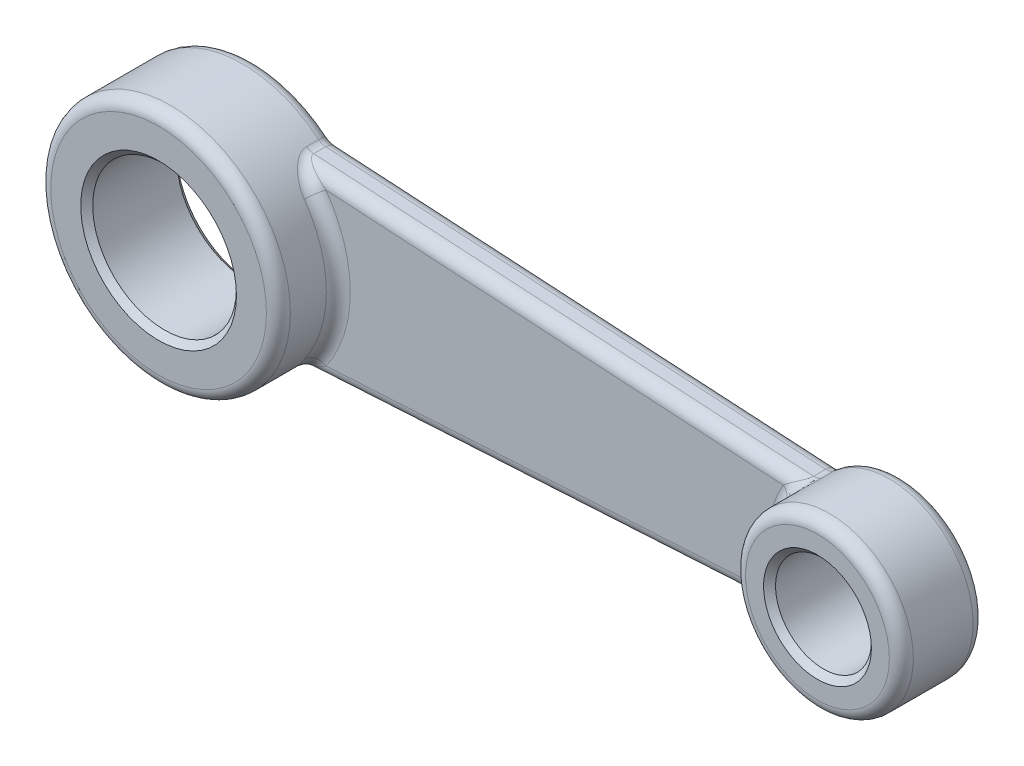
ISO-10303-21;
HEADER;
FILE_DESCRIPTION(('STEP AP214'),'2;1');
FILE_NAME('part.step','',(''),(''),'','','');
FILE_SCHEMA(('AUTOMOTIVE_DESIGN { 1 0 10303 214 1 1 1 1 }'));
ENDSEC;
DATA;
#1=APPLICATION_CONTEXT('core data for automotive mechanical design processes');
#2=APPLICATION_PROTOCOL_DEFINITION('international standard','automotive_design',2000,#1);
#3=PRODUCT_CONTEXT('',#1,'mechanical');
#4=PRODUCT('Part','Part','',(#3));
#5=PRODUCT_RELATED_PRODUCT_CATEGORY('part','',(#4));
#6=PRODUCT_DEFINITION_FORMATION('','',#4);
#7=PRODUCT_DEFINITION_CONTEXT('part definition',#1,'design');
#8=PRODUCT_DEFINITION('design','',#6,#7);
#9=PRODUCT_DEFINITION_SHAPE('','',#8);
#10=(LENGTH_UNIT() NAMED_UNIT(*) SI_UNIT(.MILLI.,.METRE.));
#11=(NAMED_UNIT(*) PLANE_ANGLE_UNIT() SI_UNIT($,.RADIAN.));
#12=(NAMED_UNIT(*) SI_UNIT($,.STERADIAN.) SOLID_ANGLE_UNIT());
#13=UNCERTAINTY_MEASURE_WITH_UNIT(LENGTH_MEASURE(1.E-05),#10,'distance_accuracy_value','');
#14=(GEOMETRIC_REPRESENTATION_CONTEXT(3) GLOBAL_UNCERTAINTY_ASSIGNED_CONTEXT((#13)) GLOBAL_UNIT_ASSIGNED_CONTEXT((#10,
#11,#12)) REPRESENTATION_CONTEXT('',''));
#15=CARTESIAN_POINT('',(0.,0.,0.));
#16=DIRECTION('',(0.,0.,1.));
#17=DIRECTION('',(1.,0.,0.));
#18=AXIS2_PLACEMENT_3D('',#15,#16,#17);
#19=CARTESIAN_POINT('',(0.,0.,0.));
#20=DIRECTION('',(0.,0.,1.));
#21=DIRECTION('',(1.,0.,0.));
#22=AXIS2_PLACEMENT_3D('',#19,#20,#21);
#23=PLANE('',#22);
#24=CARTESIAN_POINT('',(171.45,0.,0.));
#25=DIRECTION('',(0.,0.,1.));
#26=DIRECTION('',(1.,0.,0.));
#27=AXIS2_PLACEMENT_3D('',#24,#25,#26);
#28=CIRCLE('',#27,14.2875);
#29=CARTESIAN_POINT('',(185.7375,0.,0.));
#30=VERTEX_POINT('',#29);
#31=EDGE_CURVE('E444',#30,#30,#28,.T.);
#32=ORIENTED_EDGE('',*,*,#31,.T.);
#33=EDGE_LOOP('',(#32));
#34=FACE_BOUND('',#33,.T.);
#35=CARTESIAN_POINT('',(0.,0.,0.));
#36=DIRECTION('',(0.,0.,1.));
#37=DIRECTION('',(1.,0.,0.));
#38=AXIS2_PLACEMENT_3D('',#35,#36,#37);
#39=CIRCLE('',#38,20.6375);
#40=CARTESIAN_POINT('',(20.6375,0.,0.));
#41=VERTEX_POINT('',#40);
#42=EDGE_CURVE('E440',#41,#41,#39,.T.);
#43=ORIENTED_EDGE('',*,*,#42,.T.);
#44=EDGE_LOOP('',(#43));
#45=FACE_BOUND('',#44,.T.);
#46=CARTESIAN_POINT('',(22.2508432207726,-26.919427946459,0.));
#47=DIRECTION('',(0.,0.,1.));
#48=DIRECTION('',(1.,0.,0.));
#49=AXIS2_PLACEMENT_3D('',#46,#47,#48);
#50=CIRCLE('',#49,6.35);
#51=CARTESIAN_POINT('',(18.2052353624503,-22.0249865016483,0.));
#52=VERTEX_POINT('',#51);
#53=CARTESIAN_POINT('',(21.8778415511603,-20.580392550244,0.));
#54=VERTEX_POINT('',#53);
#55=EDGE_CURVE('E376',#52,#54,#50,.F.);
#56=ORIENTED_EDGE('',*,*,#55,.F.);
#57=CARTESIAN_POINT('',(0.,0.,0.));
#58=DIRECTION('',(0.,0.,1.));
#59=DIRECTION('',(1.,0.,0.));
#60=AXIS2_PLACEMENT_3D('',#57,#58,#59);
#61=CIRCLE('',#60,28.575);
#62=CARTESIAN_POINT('',(18.2052353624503,22.0249865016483,0.));
#63=VERTEX_POINT('',#62);
#64=EDGE_CURVE('E373',#52,#63,#61,.F.);
#65=ORIENTED_EDGE('',*,*,#64,.T.);
#66=CARTESIAN_POINT('',(22.2508432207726,26.919427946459,0.));
#67=DIRECTION('',(0.,0.,1.));
#68=DIRECTION('',(1.,0.,0.));
#69=AXIS2_PLACEMENT_3D('',#66,#67,#68);
#70=CIRCLE('',#69,6.35);
#71=CARTESIAN_POINT('',(21.8778415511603,20.580392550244,0.));
#72=VERTEX_POINT('',#71);
#73=EDGE_CURVE('E371',#72,#63,#70,.F.);
#74=ORIENTED_EDGE('',*,*,#73,.F.);
#75=DIRECTION('',(-0.998273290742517,0.0587404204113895,0.));
#76=VECTOR('',#75,1.);
#77=CARTESIAN_POINT('',(1.28230160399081,21.7922757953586,0.));
#78=LINE('',#77,#76);
#79=CARTESIAN_POINT('',(154.360615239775,12.7848380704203,0.));
#80=VERTEX_POINT('',#79);
#81=EDGE_CURVE('E367',#72,#80,#78,.F.);
#82=ORIENTED_EDGE('',*,*,#81,.T.);
#83=CARTESIAN_POINT('',(154.733616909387,19.1238734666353,0.));
#84=DIRECTION('',(0.,0.,1.));
#85=DIRECTION('',(1.,0.,0.));
#86=AXIS2_PLACEMENT_3D('',#83,#84,#85);
#87=CIRCLE('',#86,6.35);
#88=CARTESIAN_POINT('',(158.91271268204,14.3429050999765,0.));
#89=VERTEX_POINT('',#88);
#90=EDGE_CURVE('E364',#89,#80,#87,.F.);
#91=ORIENTED_EDGE('',*,*,#90,.F.);
#92=CARTESIAN_POINT('',(171.45,0.,0.));
#93=DIRECTION('',(0.,0.,1.));
#94=DIRECTION('',(1.,0.,0.));
#95=AXIS2_PLACEMENT_3D('',#92,#93,#94);
#96=CIRCLE('',#95,19.05);
#97=CARTESIAN_POINT('',(158.91271268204,-14.3429050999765,0.));
#98=VERTEX_POINT('',#97);
#99=EDGE_CURVE('E362',#89,#98,#96,.F.);
#100=ORIENTED_EDGE('',*,*,#99,.T.);
#101=CARTESIAN_POINT('',(154.733616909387,-19.1238734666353,0.));
#102=DIRECTION('',(0.,0.,1.));
#103=DIRECTION('',(1.,0.,0.));
#104=AXIS2_PLACEMENT_3D('',#101,#102,#103);
#105=CIRCLE('',#104,6.35);
#106=CARTESIAN_POINT('',(154.360615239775,-12.7848380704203,0.));
#107=VERTEX_POINT('',#106);
#108=EDGE_CURVE('E171',#107,#98,#105,.F.);
#109=ORIENTED_EDGE('',*,*,#108,.F.);
#110=DIRECTION('',(0.998273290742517,0.0587404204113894,0.));
#111=VECTOR('',#110,1.);
#112=CARTESIAN_POINT('',(1.28230160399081,-21.7922757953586,0.));
#113=LINE('',#112,#111);
#114=EDGE_CURVE('E369',#107,#54,#113,.F.);
#115=ORIENTED_EDGE('',*,*,#114,.T.);
#116=EDGE_LOOP('',(#56,#65,#74,#82,#91,#100,#109,#115));
#117=FACE_BOUND('',#116,.T.);
#118=ADVANCED_FACE('F28',(#34,#45,#117),#23,.F.);
#119=CARTESIAN_POINT('',(171.45,0.,22.225));
#120=DIRECTION('',(0.,0.,-1.));
#121=DIRECTION('',(-1.,0.,0.));
#122=AXIS2_PLACEMENT_3D('',#119,#120,#121);
#123=CYLINDRICAL_SURFACE('',#122,22.225);
#124=CARTESIAN_POINT('',(171.45,0.,19.05));
#125=DIRECTION('',(0.,0.,1.));
#126=DIRECTION('',(1.,0.,0.));
#127=AXIS2_PLACEMENT_3D('',#124,#125,#126);
#128=CIRCLE('',#127,22.225);
#129=CARTESIAN_POINT('',(193.675,0.,19.05));
#130=VERTEX_POINT('',#129);
#131=EDGE_CURVE('E284',#130,#130,#128,.F.);
#132=ORIENTED_EDGE('',*,*,#131,.T.);
#133=EDGE_LOOP('',(#132));
#134=FACE_BOUND('',#133,.T.);
#135=CARTESIAN_POINT('',(156.614831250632,16.5489695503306,4.67686846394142));
#136=CARTESIAN_POINT('',(155.650451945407,15.68446075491,5.17505124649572));
#137=CARTESIAN_POINT('',(154.315610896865,15.8555902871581,5.51343423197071));
#138=CARTESIAN_POINT('',(156.648301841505,16.57896633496,4.81028831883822));
#139=CARTESIAN_POINT('',(155.681442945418,15.7157489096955,5.2669670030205));
#140=CARTESIAN_POINT('',(154.352791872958,15.8716689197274,5.58014415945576));
#141=CARTESIAN_POINT('',(156.678161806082,16.6055578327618,4.94595041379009));
#142=CARTESIAN_POINT('',(155.709218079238,15.7436088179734,5.36124502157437));
#143=CARTESIAN_POINT('',(154.385967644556,15.8859159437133,5.64797520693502));
#144=CARTESIAN_POINT('',(156.730016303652,16.6515457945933,5.22086780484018));
#145=CARTESIAN_POINT('',(155.757501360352,15.7918362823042,5.55315993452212));
#146=CARTESIAN_POINT('',(154.443586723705,15.9105479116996,5.78543390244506));
#147=CARTESIAN_POINT('',(156.752005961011,16.6709377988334,5.36012527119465));
#148=CARTESIAN_POINT('',(155.778041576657,15.812236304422,5.65086441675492));
#149=CARTESIAN_POINT('',(154.468024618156,15.9209304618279,5.85506263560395));
#150=CARTESIAN_POINT('',(156.787351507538,16.7020328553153,5.64053112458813));
#151=CARTESIAN_POINT('',(155.811061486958,15.8449498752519,5.84816944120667));
#152=CARTESIAN_POINT('',(154.507307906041,15.9375760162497,5.99526556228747));
#153=CARTESIAN_POINT('',(156.800746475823,16.713770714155,5.78166793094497));
#154=CARTESIAN_POINT('',(155.823604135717,15.8573264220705,5.94783436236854));
#155=CARTESIAN_POINT('',(154.522196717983,15.9438576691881,6.0658339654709));
#156=CARTESIAN_POINT('',(156.818651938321,16.7294478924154,6.06520264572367));
#157=CARTESIAN_POINT('',(155.840361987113,15.8738482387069,6.14829142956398));
#158=CARTESIAN_POINT('',(154.542099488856,15.9522469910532,6.20760132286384));
#159=CARTESIAN_POINT('',(156.823164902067,16.7333893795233,6.20760019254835));
#160=CARTESIAN_POINT('',(155.844593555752,15.8780096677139,6.24916630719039));
#161=CARTESIAN_POINT('',(154.547116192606,15.9543558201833,6.27880009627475));
#162=CARTESIAN_POINT('',(156.823164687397,16.7333891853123,6.49502853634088));
#163=CARTESIAN_POINT('',(155.844593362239,15.8780094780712,6.4526951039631));
#164=CARTESIAN_POINT('',(154.547115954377,15.9543557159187,6.42251426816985));
#165=CARTESIAN_POINT('',(156.818483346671,16.7293006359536,6.64005941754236));
#166=CARTESIAN_POINT('',(155.840203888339,15.8736927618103,6.55543724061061));
#167=CARTESIAN_POINT('',(154.541912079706,15.9521682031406,6.4950297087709));
#168=CARTESIAN_POINT('',(156.799911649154,16.713039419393,6.92881188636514));
#169=CARTESIAN_POINT('',(155.822822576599,15.8565554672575,6.75957078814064));
#170=CARTESIAN_POINT('',(154.521268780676,15.9434663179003,6.63940594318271));
#171=CARTESIAN_POINT('',(156.786016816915,16.7008628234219,7.07253280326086));
#172=CARTESIAN_POINT('',(155.809811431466,15.8437158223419,6.86104924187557));
#173=CARTESIAN_POINT('',(154.505824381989,15.9369498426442,6.7112664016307));
#174=CARTESIAN_POINT('',(156.749468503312,16.6687008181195,7.35724653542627));
#175=CARTESIAN_POINT('',(155.775672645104,15.8098844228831,7.06133865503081));
#176=CARTESIAN_POINT('',(154.465204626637,15.9197328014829,6.85362326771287));
#177=CARTESIAN_POINT('',(156.726820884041,16.6487206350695,7.49824111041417));
#178=CARTESIAN_POINT('',(155.754521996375,15.7888697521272,7.16023099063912));
#179=CARTESIAN_POINT('',(154.440035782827,15.9090350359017,6.92412055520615));
#180=CARTESIAN_POINT('',(156.673434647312,16.601355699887,7.77658368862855));
#181=CARTESIAN_POINT('',(155.704816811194,15.7392020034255,7.35443568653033));
#182=CARTESIAN_POINT('',(154.380715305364,15.8836648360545,7.06329184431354));
#183=CARTESIAN_POINT('',(156.64269190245,16.5739671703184,7.91392979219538));
#184=CARTESIAN_POINT('',(155.676219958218,15.7105059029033,7.44981347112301));
#185=CARTESIAN_POINT('',(154.346559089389,15.8689903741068,7.13196489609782));
#186=CARTESIAN_POINT('',(156.540131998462,16.4819551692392,8.31668378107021));
#187=CARTESIAN_POINT('',(155.581008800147,15.6142806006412,7.72798410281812));
#188=CARTESIAN_POINT('',(154.232633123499,15.8196672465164,7.33334189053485));
#189=CARTESIAN_POINT('',(156.45759501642,16.4071520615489,8.57562785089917));
#190=CARTESIAN_POINT('',(155.504642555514,15.5362870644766,7.90421636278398));
#191=CARTESIAN_POINT('',(154.14097438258,15.7795407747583,7.46281392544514));
#192=CARTESIAN_POINT('',(156.270505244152,16.2342168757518,9.07190897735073));
#193=CARTESIAN_POINT('',(155.333443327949,15.3579622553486,8.2350240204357));
#194=CARTESIAN_POINT('',(153.933321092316,15.6866486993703,7.71095448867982));
#195=CARTESIAN_POINT('',(156.16592255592,16.1360530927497,9.30921605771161));
#196=CARTESIAN_POINT('',(155.238208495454,15.2571789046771,8.38975669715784));
#197=CARTESIAN_POINT('',(153.817293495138,15.6338659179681,7.82960802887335));
#198=CARTESIAN_POINT('',(155.888115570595,15.8691690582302,9.86652747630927));
#199=CARTESIAN_POINT('',(154.987873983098,14.9860649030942,8.74368565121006));
#200=CARTESIAN_POINT('',(153.509290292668,15.4901433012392,8.10826373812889));
#201=CARTESIAN_POINT('',(155.705656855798,15.6889167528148,10.1733357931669));
#202=CARTESIAN_POINT('',(154.825689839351,14.8051924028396,8.92844061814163));
#203=CARTESIAN_POINT('',(153.307165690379,15.3929004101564,8.26166789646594));
#204=CARTESIAN_POINT('',(155.320905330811,15.2931177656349,10.7368386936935));
#205=CARTESIAN_POINT('',(154.492268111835,14.4186172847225,9.246037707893));
#206=CARTESIAN_POINT('',(152.881470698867,15.1788414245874,8.54341934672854));
#207=CARTESIAN_POINT('',(155.118580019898,15.0775128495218,10.9934490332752));
#208=CARTESIAN_POINT('',(154.320331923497,14.2117693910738,9.37812914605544));
#209=CARTESIAN_POINT('',(152.657865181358,15.0619930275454,8.67172451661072));
#210=CARTESIAN_POINT('',(154.699946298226,14.6111827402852,11.4610162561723));
#211=CARTESIAN_POINT('',(153.975402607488,13.7795204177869,9.59269950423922));
#212=CARTESIAN_POINT('',(152.195877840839,14.808626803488,8.90550812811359));
#213=CARTESIAN_POINT('',(154.483430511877,14.3598008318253,11.6708701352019));
#214=CARTESIAN_POINT('',(153.802270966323,13.5531147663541,9.67283990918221));
#215=CARTESIAN_POINT('',(151.957281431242,14.6717393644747,9.01043506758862));
#216=CARTESIAN_POINT('',(154.048803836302,13.8298991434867,12.035638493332));
#217=CARTESIAN_POINT('',(153.468334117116,13.0977943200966,9.77959572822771));
#218=CARTESIAN_POINT('',(151.479178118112,14.3824570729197,9.19281924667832));
#219=CARTESIAN_POINT('',(153.830695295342,13.5514138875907,12.1906217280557));
#220=CARTESIAN_POINT('',(153.307681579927,12.8685672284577,9.80482631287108));
#221=CARTESIAN_POINT('',(151.239672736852,14.2300819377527,9.2703108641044));
#222=CARTESIAN_POINT('',(153.491613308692,13.095421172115,12.3884486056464));
#223=CARTESIAN_POINT('',(153.071234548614,12.518035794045,9.80475631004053));
#224=CARTESIAN_POINT('',(150.868098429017,13.9799775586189,9.36922430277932));
#225=CARTESIAN_POINT('',(153.368906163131,12.9255344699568,12.4509234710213));
#226=CARTESIAN_POINT('',(152.987800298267,12.3912705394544,9.79603797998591));
#227=CARTESIAN_POINT('',(150.73379619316,13.886676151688,9.40046173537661));
#228=CARTESIAN_POINT('',(153.126232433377,12.5791428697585,12.5557783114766));
#229=CARTESIAN_POINT('',(152.827918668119,12.1434520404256,9.76283784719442));
#230=CARTESIAN_POINT('',(150.468540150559,13.6961866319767,9.45288915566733));
#231=CARTESIAN_POINT('',(153.006265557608,12.4026386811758,12.5981604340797));
#232=CARTESIAN_POINT('',(152.75161945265,12.0225414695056,9.73809422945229));
#233=CARTESIAN_POINT('',(150.337585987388,13.5989989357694,9.4740802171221));
#234=CARTESIAN_POINT('',(152.769725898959,12.0434344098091,12.6619083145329));
#235=CARTESIAN_POINT('',(152.606270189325,11.7884871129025,9.67417549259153));
#236=CARTESIAN_POINT('',(150.079757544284,13.4009570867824,9.50595415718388));
#237=CARTESIAN_POINT('',(152.653169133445,11.8607117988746,12.6831867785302));
#238=CARTESIAN_POINT('',(152.537436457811,11.6756084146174,9.63472004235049));
#239=CARTESIAN_POINT('',(149.952902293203,13.3000894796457,9.51659338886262));
#240=CARTESIAN_POINT('',(152.42495717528,11.4911269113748,12.7033405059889));
#241=CARTESIAN_POINT('',(152.407288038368,11.46012730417,9.54342581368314));
#242=CARTESIAN_POINT('',(149.704922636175,13.095816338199,9.52667025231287));
#243=CARTESIAN_POINT('',(152.31330576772,11.304261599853,12.7021987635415));
#244=CARTESIAN_POINT('',(152.346173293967,11.357818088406,9.49141974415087));
#245=CARTESIAN_POINT('',(149.583802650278,12.9924089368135,9.52609938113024));
#246=CARTESIAN_POINT('',(152.204691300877,11.1161467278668,12.6892889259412));
#247=CARTESIAN_POINT('',(152.289301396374,11.2626316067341,9.43491615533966));
#248=CARTESIAN_POINT('',(149.466189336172,12.8881832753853,9.51964446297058));
#249=(BOUNDED_SURFACE() B_SPLINE_SURFACE(3,2,((#135,#136,#137),(#138,#139,#140),(#141,#142,
#143),(#144,#145,#146),(#147,#148,#149),(#150,#151,#152),(#153,#154,#155),(#156,#157,#158),
(#159,#160,#161),(#162,#163,#164),(#165,#166,#167),(#168,#169,#170),(#171,#172,#173),(#174,#175,
#176),(#177,#178,#179),(#180,#181,#182),(#183,#184,#185),(#186,#187,#188),(#189,#190,#191),
(#192,#193,#194),(#195,#196,#197),(#198,#199,#200),(#201,#202,#203),(#204,#205,#206),(#207,#208,
#209),(#210,#211,#212),(#213,#214,#215),(#216,#217,#218),(#219,#220,#221),(#222,#223,#224),
(#225,#226,#227),(#228,#229,#230),(#231,#232,#233),(#234,#235,#236),(#237,#238,#239),(#240,#241,
#242),(#243,#244,#245),(#246,#247,#248)),.UNSPECIFIED.,.F.,.F.,
.F.) B_SPLINE_SURFACE_WITH_KNOTS((4,2,2,2,2,2,2,2,2,2,2,2,2,2,2,2,2,2,4),(3,3),(0.,
0.428853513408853,0.857972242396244,1.28512572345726,1.71216042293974,2.14707826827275,
2.58220752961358,3.01704587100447,3.45210635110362,4.31370224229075,5.17647422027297,
6.44254277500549,7.71071819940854,9.00622284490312,10.3000983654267,11.0418453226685,
11.7835129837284,12.5282358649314,13.2735236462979),(0.,1.),
.UNSPECIFIED.) GEOMETRIC_REPRESENTATION_ITEM() RATIONAL_B_SPLINE_SURFACE(((1.,0.916306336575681,
1.),(1.,0.917787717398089,1.),(1.,0.919104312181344,1.),(1.,0.921385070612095,1.),(1.,
0.922349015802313,1.),(1.,0.923896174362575,1.),(1.,0.92448111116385,1.),(1.,0.925262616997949,
1.),(1.,0.925459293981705,1.),(1.,0.925459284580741,1.),(1.,0.925255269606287,1.),(1.,
0.924444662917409,1.),(1.,0.923837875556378,1.),(1.,0.922237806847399,1.),(1.,0.921244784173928,
1.),(1.,0.918896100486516,1.),(1.,0.917540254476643,1.),(1.,0.9129982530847,1.),(1.,
0.90932088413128,1.),(1.,0.900891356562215,1.),(1.,0.896137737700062,1.),(1.,0.883350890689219,
1.),(1.,0.874823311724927,1.),(1.,0.856489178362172,1.),(1.,0.846680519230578,1.),(1.,
0.826027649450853,1.),(1.,0.815165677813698,1.),(1.,0.793061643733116,1.),(1.,0.781820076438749,
1.),(1.,0.764229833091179,1.),(1.,0.757840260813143,1.),(1.,0.745199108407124,1.),(1.,
0.738947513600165,1.),(1.,0.726666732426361,1.),(1.,0.720638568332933,1.),(1.,0.708940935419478,
1.),(1.,0.703271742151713,1.),(1.,0.697841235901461,1.))) REPRESENTATION_ITEM('') SURFACE());
#250=CARTESIAN_POINT('',(152.204691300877,11.1161467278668,12.6892889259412));
#251=CARTESIAN_POINT('',(152.31330576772,11.304261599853,12.7021987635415));
#252=CARTESIAN_POINT('',(152.42495717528,11.4911269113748,12.7033405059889));
#253=CARTESIAN_POINT('',(152.653169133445,11.8607117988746,12.6831867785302));
#254=CARTESIAN_POINT('',(152.769725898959,12.0434344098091,12.6619083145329));
#255=CARTESIAN_POINT('',(153.006265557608,12.4026386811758,12.5981604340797));
#256=CARTESIAN_POINT('',(153.126232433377,12.5791428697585,12.5557783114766));
#257=CARTESIAN_POINT('',(153.368906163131,12.9255344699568,12.4509234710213));
#258=CARTESIAN_POINT('',(153.491613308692,13.095421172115,12.3884486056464));
#259=CARTESIAN_POINT('',(153.830695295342,13.5514138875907,12.1906217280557));
#260=CARTESIAN_POINT('',(154.048803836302,13.8298991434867,12.035638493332));
#261=CARTESIAN_POINT('',(154.483430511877,14.3598008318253,11.6708701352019));
#262=CARTESIAN_POINT('',(154.699946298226,14.6111827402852,11.4610162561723));
#263=CARTESIAN_POINT('',(155.118580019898,15.0775128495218,10.9934490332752));
#264=CARTESIAN_POINT('',(155.320905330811,15.2931177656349,10.7368386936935));
#265=CARTESIAN_POINT('',(155.705656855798,15.6889167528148,10.1733357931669));
#266=CARTESIAN_POINT('',(155.888115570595,15.8691690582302,9.86652747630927));
#267=CARTESIAN_POINT('',(156.16592255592,16.1360530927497,9.30921605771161));
#268=CARTESIAN_POINT('',(156.270505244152,16.2342168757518,9.07190897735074));
#269=CARTESIAN_POINT('',(156.45759501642,16.4071520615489,8.57562785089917));
#270=CARTESIAN_POINT('',(156.540131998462,16.4819551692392,8.31668378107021));
#271=CARTESIAN_POINT('',(156.64269190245,16.5739671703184,7.91392979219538));
#272=CARTESIAN_POINT('',(156.673434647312,16.601355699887,7.77658368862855));
#273=CARTESIAN_POINT('',(156.726820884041,16.6487206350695,7.49824111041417));
#274=CARTESIAN_POINT('',(156.749468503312,16.6687008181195,7.35724653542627));
#275=CARTESIAN_POINT('',(156.786016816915,16.7008628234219,7.07253280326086));
#276=CARTESIAN_POINT('',(156.799911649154,16.713039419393,6.92881188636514));
#277=CARTESIAN_POINT('',(156.818483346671,16.7293006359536,6.64005941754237));
#278=CARTESIAN_POINT('',(156.823164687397,16.7333891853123,6.49502853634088));
#279=CARTESIAN_POINT('',(156.823164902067,16.7333893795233,6.20760019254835));
#280=CARTESIAN_POINT('',(156.818651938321,16.7294478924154,6.06520264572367));
#281=CARTESIAN_POINT('',(156.800746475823,16.713770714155,5.78166793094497));
#282=CARTESIAN_POINT('',(156.787351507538,16.7020328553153,5.64053112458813));
#283=CARTESIAN_POINT('',(156.752005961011,16.6709377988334,5.36012527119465));
#284=CARTESIAN_POINT('',(156.730016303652,16.6515457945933,5.22086780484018));
#285=CARTESIAN_POINT('',(156.678161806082,16.6055578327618,4.94595041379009));
#286=CARTESIAN_POINT('',(156.648301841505,16.57896633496,4.81028831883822));
#287=CARTESIAN_POINT('',(156.614831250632,16.5489695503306,4.67686846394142));
#288=B_SPLINE_CURVE_WITH_KNOTS('',3,(#250,#251,#252,#253,#254,#255,#256,#257,#258,#259,#260,
#261,#262,#263,#264,#265,#266,#267,#268,#269,#270,#271,#272,#273,#274,#275,#276,#277,#278,#279,
#280,#281,#282,#283,#284,#285,#286,#287),.UNSPECIFIED.,.F.,.F.,(4,2,2,2,2,2,2,2,2,2,2,2,2,2,2,2,
2,2,4),(0.,0.745287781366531,1.49001066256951,2.23167832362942,2.97342528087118,
4.26730080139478,5.56280544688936,6.83098087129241,8.09704942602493,8.95982140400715,
9.82141729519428,10.2564777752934,10.6913161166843,11.1264453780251,11.5613632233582,
11.9883979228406,12.4155514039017,12.844670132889,13.2735236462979),.UNSPECIFIED.);
#289=CARTESIAN_POINT('',(152.388504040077,11.4284730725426,12.7));
#290=VERTEX_POINT('',#289);
#291=CARTESIAN_POINT('',(156.823164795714,16.7333892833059,6.35));
#292=VERTEX_POINT('',#291);
#293=EDGE_CURVE('E277',#290,#292,#288,.T.);
#294=ORIENTED_EDGE('',*,*,#293,.F.);
#295=CARTESIAN_POINT('',(171.45,0.,12.7));
#296=DIRECTION('',(0.,0.,-1.));
#297=DIRECTION('',(-1.,0.,0.));
#298=AXIS2_PLACEMENT_3D('',#295,#296,#297);
#299=CIRCLE('',#298,22.225);
#300=CARTESIAN_POINT('',(152.388504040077,-11.4284730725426,12.7));
#301=VERTEX_POINT('',#300);
#302=EDGE_CURVE('E285',#290,#301,#299,.F.);
#303=ORIENTED_EDGE('',*,*,#302,.T.);
#304=CARTESIAN_POINT('',(151.416510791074,-9.62340558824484,12.3340181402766));
#305=CARTESIAN_POINT('',(151.903982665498,-10.6381983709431,8.90709989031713));
#306=CARTESIAN_POINT('',(148.616984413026,-12.058655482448,9.34200907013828));
#307=CARTESIAN_POINT('',(151.488138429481,-9.77256191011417,12.3961648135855));
#308=CARTESIAN_POINT('',(151.9368435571,-10.6872774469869,8.96528573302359));
#309=CARTESIAN_POINT('',(148.693705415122,-12.1417816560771,9.37308240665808));
#310=CARTESIAN_POINT('',(151.562455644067,-9.92296031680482,12.4501967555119));
#311=CARTESIAN_POINT('',(151.971269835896,-10.7406198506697,9.02302642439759));
#312=CARTESIAN_POINT('',(148.773453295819,-12.2255299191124,9.4000983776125));
#313=CARTESIAN_POINT('',(151.715976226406,-10.2248395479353,12.5422732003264));
#314=CARTESIAN_POINT('',(152.043746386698,-10.8558497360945,9.13553543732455));
#315=CARTESIAN_POINT('',(148.938487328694,-12.3934833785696,9.44613660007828));
#316=CARTESIAN_POINT('',(151.795175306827,-10.3763193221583,12.5803315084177));
#317=CARTESIAN_POINT('',(152.081711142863,-10.9175700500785,9.1902674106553));
#318=CARTESIAN_POINT('',(149.023768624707,-12.4776881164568,9.46516575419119));
#319=CARTESIAN_POINT('',(151.957774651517,-10.678631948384,12.6406914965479));
#320=CARTESIAN_POINT('',(152.161766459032,-11.049506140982,9.29515495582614));
#321=CARTESIAN_POINT('',(149.199145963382,-12.6455858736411,9.49534574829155));
#322=CARTESIAN_POINT('',(152.041157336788,-10.8294650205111,12.6630540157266));
#323=CARTESIAN_POINT('',(152.203747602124,-11.1195159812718,9.3453179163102));
#324=CARTESIAN_POINT('',(149.289221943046,-12.7292796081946,9.50652700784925));
#325=CARTESIAN_POINT('',(152.211942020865,-11.1300333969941,12.6927116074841));
#326=CARTESIAN_POINT('',(152.292439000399,-11.2678432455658,9.43976881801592));
#327=CARTESIAN_POINT('',(149.473996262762,-12.8959029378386,9.52135580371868));
#328=CARTESIAN_POINT('',(152.299345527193,-11.2797682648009,12.7000009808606));
#329=CARTESIAN_POINT('',(152.339054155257,-11.3459969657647,9.48408298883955));
#330=CARTESIAN_POINT('',(149.568696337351,-12.9788322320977,9.52500049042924));
#331=CARTESIAN_POINT('',(152.510539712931,-11.632012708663,12.6999986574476));
#332=CARTESIAN_POINT('',(152.45517094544,-11.5396649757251,9.58016313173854));
#333=CARTESIAN_POINT('',(149.797841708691,-13.1737325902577,9.52499932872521));
#334=CARTESIAN_POINT('',(152.635863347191,-11.8336225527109,12.686339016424));
#335=CARTESIAN_POINT('',(152.526926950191,-11.6586077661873,9.62910066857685));
#336=CARTESIAN_POINT('',(149.934066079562,-13.2851363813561,9.51816950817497));
#337=CARTESIAN_POINT('',(152.891724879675,-12.2309850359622,12.6331013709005));
#338=CARTESIAN_POINT('',(152.680112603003,-11.9080812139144,9.71008802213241));
#339=CARTESIAN_POINT('',(150.212659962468,-13.5044107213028,9.49155068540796));
#340=CARTESIAN_POINT('',(153.022267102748,-12.4267325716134,12.5935014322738));
#341=CARTESIAN_POINT('',(152.761307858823,-12.0383013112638,9.74238973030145));
#342=CARTESIAN_POINT('',(150.355034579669,-13.6122781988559,9.47175071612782));
#343=CARTESIAN_POINT('',(153.287336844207,-12.8110450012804,12.4896508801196));
#344=CARTESIAN_POINT('',(152.932974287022,-12.3071816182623,9.78777822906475));
#345=CARTESIAN_POINT('',(150.644571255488,-13.8237610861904,9.41982544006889));
#346=CARTESIAN_POINT('',(153.421872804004,-12.9995924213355,12.4253440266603));
#347=CARTESIAN_POINT('',(153.023258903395,-12.4456466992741,9.8011611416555));
#348=CARTESIAN_POINT('',(150.791743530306,-13.9273661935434,9.38767201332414));
#349=CARTESIAN_POINT('',(153.693018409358,-13.3675934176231,12.2734088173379));
#350=CARTESIAN_POINT('',(153.211693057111,-12.7270646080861,9.80707405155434));
#351=CARTESIAN_POINT('',(151.088758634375,-14.1292925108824,9.31170440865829));
#352=CARTESIAN_POINT('',(153.829627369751,-13.5470499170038,12.1857880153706));
#353=CARTESIAN_POINT('',(153.309682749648,-12.8699117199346,9.79998568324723));
#354=CARTESIAN_POINT('',(151.238600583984,-14.2276154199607,9.26789400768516));
#355=CARTESIAN_POINT('',(154.201762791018,-14.0211832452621,11.9172872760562));
#356=CARTESIAN_POINT('',(153.583001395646,-13.2573339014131,9.75143665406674));
#357=CARTESIAN_POINT('',(151.647277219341,-14.4870140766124,9.13364363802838));
#358=CARTESIAN_POINT('',(154.437934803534,-14.3061444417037,11.7146018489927));
#359=CARTESIAN_POINT('',(153.765993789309,-13.505618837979,9.68992794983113));
#360=CARTESIAN_POINT('',(151.907173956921,-14.6424972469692,9.03230092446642));
#361=CARTESIAN_POINT('',(154.902232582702,-14.840727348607,11.2471512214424));
#362=CARTESIAN_POINT('',(154.139419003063,-13.988525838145,9.50049104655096));
#363=CARTESIAN_POINT('',(152.418971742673,-14.9334695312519,8.79857561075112));
#364=CARTESIAN_POINT('',(155.130369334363,-15.0903988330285,10.9824748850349));
#365=CARTESIAN_POINT('',(154.329972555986,-14.2239726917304,9.37430055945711));
#366=CARTESIAN_POINT('',(152.670883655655,-15.068986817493,8.66623744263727));
#367=CARTESIAN_POINT('',(155.524780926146,-15.5049560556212,10.4483851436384));
#368=CARTESIAN_POINT('',(154.668179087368,-14.6245423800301,9.08624685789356));
#369=CARTESIAN_POINT('',(153.106971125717,-15.293478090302,8.39919257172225));
#370=CARTESIAN_POINT('',(155.69454675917,-15.6769267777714,10.1895404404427));
#371=CARTESIAN_POINT('',(154.81689930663,-14.7945805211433,8.93698699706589));
#372=CARTESIAN_POINT('',(153.294892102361,-15.3863976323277,8.26977021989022));
#373=CARTESIAN_POINT('',(156.011640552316,-15.989278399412,9.63183991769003));
#374=CARTESIAN_POINT('',(155.098311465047,-15.1070698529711,8.59698793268));
#375=CARTESIAN_POINT('',(153.646193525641,-15.5548749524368,7.9909199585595));
#376=CARTESIAN_POINT('',(156.158994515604,-16.1296959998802,9.33303123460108));
#377=CARTESIAN_POINT('',(155.231679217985,-15.2504441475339,8.40650543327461));
#378=CARTESIAN_POINT('',(153.809602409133,-15.6304529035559,7.84151561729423));
#379=CARTESIAN_POINT('',(156.387829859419,-16.3431989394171,8.77294120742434));
#380=CARTESIAN_POINT('',(155.4405121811,-15.4700414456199,8.0368963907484));
#381=CARTESIAN_POINT('',(154.06352326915,-15.7452077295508,7.56147060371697));
#382=CARTESIAN_POINT('',(156.476640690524,-16.4243556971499,8.51969062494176));
#383=CARTESIAN_POINT('',(155.522387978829,-15.5543627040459,7.86616752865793));
#384=CARTESIAN_POINT('',(154.162126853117,-15.7887671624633,7.43484531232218));
#385=CARTESIAN_POINT('',(156.589610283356,-16.5264032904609,8.1258767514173));
#386=CARTESIAN_POINT('',(155.626986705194,-15.660810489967,7.59612974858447));
#387=CARTESIAN_POINT('',(154.287592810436,-15.8434958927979,7.23793837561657));
#388=CARTESIAN_POINT('',(156.623883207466,-16.5571299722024,7.99233574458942));
#389=CARTESIAN_POINT('',(155.65878334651,-15.6929229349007,7.50401204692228));
#390=CARTESIAN_POINT('',(154.325664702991,-15.85996616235,7.17116787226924));
#391=CARTESIAN_POINT('',(156.684913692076,-16.6115781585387,7.72123267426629));
#392=CARTESIAN_POINT('',(155.715478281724,-15.74989533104,7.31594372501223));
#393=CARTESIAN_POINT('',(154.393469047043,-15.889141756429,7.03561633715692));
#394=CARTESIAN_POINT('',(156.711674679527,-16.6353028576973,7.58367247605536));
#395=CARTESIAN_POINT('',(155.740420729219,-15.7748007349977,7.21993695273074));
#396=CARTESIAN_POINT('',(154.423205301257,-15.9018487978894,6.96683623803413));
#397=CARTESIAN_POINT('',(156.757155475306,-16.6754873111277,7.30422872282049));
#398=CARTESIAN_POINT('',(155.782835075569,-15.8170059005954,7.02414873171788));
#399=CARTESIAN_POINT('',(154.473747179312,-15.9233666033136,6.82711436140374));
#400=CARTESIAN_POINT('',(156.775806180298,-16.6918846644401,7.16231863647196));
#401=CARTESIAN_POINT('',(155.800277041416,-15.8342748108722,6.92426825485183));
#402=CARTESIAN_POINT('',(154.494476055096,-15.9321439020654,6.75615931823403));
#403=CARTESIAN_POINT('',(156.804163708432,-16.716771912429,6.87649822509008));
#404=CARTESIAN_POINT('',(155.826792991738,-15.8604802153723,6.72266485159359));
#405=CARTESIAN_POINT('',(154.525994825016,-15.9454640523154,6.61324911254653));
#406=CARTESIAN_POINT('',(156.813874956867,-16.7252657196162,6.73258892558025));
#407=CARTESIAN_POINT('',(155.835893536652,-15.8694430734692,6.62086003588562));
#408=CARTESIAN_POINT('',(154.536789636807,-15.9500089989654,6.5412944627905));
#409=CARTESIAN_POINT('',(156.82406113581,-16.7341741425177,6.44374778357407));
#410=CARTESIAN_POINT('',(155.845431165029,-15.8788355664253,6.41643085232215));
#411=CARTESIAN_POINT('',(154.548112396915,-15.9547757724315,6.39687389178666));
#412=CARTESIAN_POINT('',(156.824518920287,-16.7345737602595,6.29881454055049));
#413=CARTESIAN_POINT('',(155.84586051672,-15.879257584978,6.31371611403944));
#414=CARTESIAN_POINT('',(154.548621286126,-15.9549895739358,6.32440727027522));
#415=CARTESIAN_POINT('',(156.816138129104,-16.7272455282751,6.00958840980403));
#416=CARTESIAN_POINT('',(155.838012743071,-15.8715305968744,6.10898184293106));
#417=CARTESIAN_POINT('',(154.53930531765,-15.9510683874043,6.17979420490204));
#418=CARTESIAN_POINT('',(156.807300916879,-16.7195188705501,5.86529543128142));
#419=CARTESIAN_POINT('',(155.829730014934,-15.863376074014,6.00687274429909));
#420=CARTESIAN_POINT('',(154.529481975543,-15.9469340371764,6.10764771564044));
#421=CARTESIAN_POINT('',(156.782265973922,-16.6975578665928,5.59627082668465));
#422=CARTESIAN_POINT('',(155.806318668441,-15.8402498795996,5.8170415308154));
#423=CARTESIAN_POINT('',(154.501655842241,-15.9351804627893,5.97313541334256));
#424=CARTESIAN_POINT('',(156.767104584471,-16.6842384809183,5.4713116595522));
#425=CARTESIAN_POINT('',(155.792138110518,-15.826220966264,5.72901798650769));
#426=CARTESIAN_POINT('',(154.484804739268,-15.9280511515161,5.91065582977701));
#427=CARTESIAN_POINT('',(156.730219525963,-16.6517053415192,5.22367025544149));
#428=CARTESIAN_POINT('',(155.757715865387,-15.792029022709,5.55520627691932));
#429=CARTESIAN_POINT('',(154.443813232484,-15.910632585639,5.78683512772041));
#430=CARTESIAN_POINT('',(156.708495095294,-16.6324909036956,5.10098828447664));
#431=CARTESIAN_POINT('',(155.737451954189,-15.7718437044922,5.46936741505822));
#432=CARTESIAN_POINT('',(154.419671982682,-15.9003429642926,5.72549414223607));
#433=CARTESIAN_POINT('',(156.658989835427,-16.5884821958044,4.85874907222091));
#434=CARTESIAN_POINT('',(155.691396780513,-15.7257299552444,5.30070391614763));
#435=CARTESIAN_POINT('',(154.364666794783,-15.8767671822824,5.6043745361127));
#436=CARTESIAN_POINT('',(156.631216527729,-16.5636948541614,4.73918815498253));
#437=CARTESIAN_POINT('',(155.665585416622,-15.6997811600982,5.21783208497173));
#438=CARTESIAN_POINT('',(154.333811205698,-15.8634847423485,5.54459407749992));
#439=CARTESIAN_POINT('',(156.57016636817,-16.5088714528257,4.50359844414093));
#440=CARTESIAN_POINT('',(155.609025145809,-15.6425659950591,5.05552476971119));
#441=CARTESIAN_POINT('',(154.265996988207,-15.8340946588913,5.4267992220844));
#442=CARTESIAN_POINT('',(156.536892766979,-16.4788384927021,4.38756761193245));
#443=CARTESIAN_POINT('',(155.578248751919,-15.6112710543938,4.97605215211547));
#444=CARTESIAN_POINT('',(154.229041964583,-15.8179886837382,5.36878380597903));
#445=CARTESIAN_POINT('',(156.501136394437,-16.4463400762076,4.27351327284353));
#446=CARTESIAN_POINT('',(155.545344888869,-15.5775755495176,4.89867309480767));
#447=CARTESIAN_POINT('',(154.189336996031,-15.800552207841,5.31175663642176));
#448=(BOUNDED_SURFACE() B_SPLINE_SURFACE(3,2,((#304,#305,#306),(#307,#308,#309),(#310,#311,
#312),(#313,#314,#315),(#316,#317,#318),(#319,#320,#321),(#322,#323,#324),(#325,#326,#327),
(#328,#329,#330),(#331,#332,#333),(#334,#335,#336),(#337,#338,#339),(#340,#341,#342),(#343,#344,
#345),(#346,#347,#348),(#349,#350,#351),(#352,#353,#354),(#355,#356,#357),(#358,#359,#360),
(#361,#362,#363),(#364,#365,#366),(#367,#368,#369),(#370,#371,#372),(#373,#374,#375),(#376,#377,
#378),(#379,#380,#381),(#382,#383,#384),(#385,#386,#387),(#388,#389,#390),(#391,#392,#393),
(#394,#395,#396),(#397,#398,#399),(#400,#401,#402),(#403,#404,#405),(#406,#407,#408),(#409,#410,
#411),(#412,#413,#414),(#415,#416,#417),(#418,#419,#420),(#421,#422,#423),(#424,#425,#426),
(#427,#428,#429),(#430,#431,#432),(#433,#434,#435),(#436,#437,#438),(#439,#440,#441),(#442,#443,
#444),(#445,#446,#447)),.UNSPECIFIED.,.F.,.F.,.F.) B_SPLINE_SURFACE_WITH_KNOTS((4,2,2,2,2,2,2,2,
2,2,2,2,2,2,2,2,2,2,2,2,2,2,2,4),(3,3),(0.,0.596882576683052,1.19324823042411,1.78728932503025,
2.38155498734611,3.19495583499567,4.0090453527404,4.82499905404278,5.64068870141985,
7.04164078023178,8.4405967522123,9.57224292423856,10.7025659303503,11.5634778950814,
11.9936077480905,12.4235410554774,12.8570690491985,13.2903823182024,13.7244984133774,
14.1585508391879,14.5393377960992,14.9201689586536,15.3005292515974,15.6806655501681),(0.,1.),
.UNSPECIFIED.) GEOMETRIC_REPRESENTATION_ITEM() RATIONAL_B_SPLINE_SURFACE(((1.,0.660715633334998,
1.),(1.,0.663795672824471,1.),(1.,0.66710292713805,1.),(1.,0.674128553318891,1.),(1.,
0.677846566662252,1.),(1.,0.685640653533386,1.),(1.,0.68971527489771,1.),(1.,0.698184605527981,
1.),(1.,0.702579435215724,1.),(1.,0.713303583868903,1.),(1.,0.719748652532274,1.),(1.,
0.732988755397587,1.),(1.,0.739784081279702,1.),(1.,0.753590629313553,1.),(1.,0.760602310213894,
1.),(1.,0.77468405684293,1.),(1.,0.78175410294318,1.),(1.,0.800884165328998,1.),(1.,
0.812884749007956,1.),(1.,0.836074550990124,1.),(1.,0.847264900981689,1.),(1.,0.866249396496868,
1.),(1.,0.874283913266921,1.),(1.,0.889072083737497,1.),(1.,0.895827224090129,1.),(1.,
0.906192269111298,1.),(1.,0.910168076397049,1.),(1.,0.915191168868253,1.),(1.,0.9167083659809,
1.),(1.,0.919402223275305,1.),(1.,0.920579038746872,1.),(1.,0.922574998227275,1.),(1.,
0.923391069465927,1.),(1.,0.924630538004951,1.),(1.,0.925054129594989,1.),(1.,0.9254984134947,
1.),(1.,0.925518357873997,1.),(1.,0.925152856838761,1.),(1.,0.924767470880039,1.),(1.,
0.923673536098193,1.),(1.,0.923010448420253,1.),(1.,0.921393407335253,1.),(1.,0.920439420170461,
1.),(1.,0.918258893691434,1.),(1.,0.917032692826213,1.),(1.,0.914327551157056,1.),(1.,
0.912848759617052,1.),(1.,0.911253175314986,1.))) REPRESENTATION_ITEM('') SURFACE());
#449=CARTESIAN_POINT('',(156.501136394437,-16.4463400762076,4.27351327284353));
#450=CARTESIAN_POINT('',(156.536892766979,-16.4788384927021,4.38756761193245));
#451=CARTESIAN_POINT('',(156.57016636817,-16.5088714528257,4.50359844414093));
#452=CARTESIAN_POINT('',(156.631216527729,-16.5636948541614,4.73918815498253));
#453=CARTESIAN_POINT('',(156.658989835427,-16.5884821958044,4.85874907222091));
#454=CARTESIAN_POINT('',(156.708495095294,-16.6324909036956,5.10098828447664));
#455=CARTESIAN_POINT('',(156.730219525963,-16.6517053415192,5.22367025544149));
#456=CARTESIAN_POINT('',(156.767104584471,-16.6842384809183,5.4713116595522));
#457=CARTESIAN_POINT('',(156.782265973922,-16.6975578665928,5.59627082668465));
#458=CARTESIAN_POINT('',(156.807300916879,-16.7195188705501,5.86529543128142));
#459=CARTESIAN_POINT('',(156.816138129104,-16.7272455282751,6.00958840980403));
#460=CARTESIAN_POINT('',(156.824518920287,-16.7345737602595,6.29881454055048));
#461=CARTESIAN_POINT('',(156.82406113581,-16.7341741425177,6.44374778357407));
#462=CARTESIAN_POINT('',(156.813874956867,-16.7252657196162,6.73258892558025));
#463=CARTESIAN_POINT('',(156.804163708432,-16.716771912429,6.87649822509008));
#464=CARTESIAN_POINT('',(156.775806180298,-16.6918846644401,7.16231863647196));
#465=CARTESIAN_POINT('',(156.757155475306,-16.6754873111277,7.30422872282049));
#466=CARTESIAN_POINT('',(156.711674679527,-16.6353028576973,7.58367247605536));
#467=CARTESIAN_POINT('',(156.684913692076,-16.6115781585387,7.72123267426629));
#468=CARTESIAN_POINT('',(156.623883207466,-16.5571299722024,7.99233574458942));
#469=CARTESIAN_POINT('',(156.589610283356,-16.5264032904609,8.1258767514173));
#470=CARTESIAN_POINT('',(156.476640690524,-16.4243556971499,8.51969062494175));
#471=CARTESIAN_POINT('',(156.387829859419,-16.3431989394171,8.77294120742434));
#472=CARTESIAN_POINT('',(156.158994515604,-16.1296959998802,9.33303123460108));
#473=CARTESIAN_POINT('',(156.011640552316,-15.989278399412,9.63183991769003));
#474=CARTESIAN_POINT('',(155.69454675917,-15.6769267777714,10.1895404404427));
#475=CARTESIAN_POINT('',(155.524780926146,-15.5049560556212,10.4483851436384));
#476=CARTESIAN_POINT('',(155.130369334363,-15.0903988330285,10.9824748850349));
#477=CARTESIAN_POINT('',(154.902232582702,-14.840727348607,11.2471512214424));
#478=CARTESIAN_POINT('',(154.437934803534,-14.3061444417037,11.7146018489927));
#479=CARTESIAN_POINT('',(154.201762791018,-14.0211832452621,11.9172872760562));
#480=CARTESIAN_POINT('',(153.829627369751,-13.5470499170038,12.1857880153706));
#481=CARTESIAN_POINT('',(153.693018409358,-13.3675934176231,12.2734088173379));
#482=CARTESIAN_POINT('',(153.421872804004,-12.9995924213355,12.4253440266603));
#483=CARTESIAN_POINT('',(153.287336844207,-12.8110450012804,12.4896508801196));
#484=CARTESIAN_POINT('',(153.022267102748,-12.4267325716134,12.5935014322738));
#485=CARTESIAN_POINT('',(152.891724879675,-12.2309850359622,12.6331013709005));
#486=CARTESIAN_POINT('',(152.635863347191,-11.8336225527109,12.686339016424));
#487=CARTESIAN_POINT('',(152.510539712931,-11.632012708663,12.6999986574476));
#488=CARTESIAN_POINT('',(152.299345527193,-11.2797682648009,12.7000009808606));
#489=CARTESIAN_POINT('',(152.211942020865,-11.1300333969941,12.6927116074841));
#490=CARTESIAN_POINT('',(152.041157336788,-10.8294650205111,12.6630540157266));
#491=CARTESIAN_POINT('',(151.957774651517,-10.678631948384,12.6406914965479));
#492=CARTESIAN_POINT('',(151.795175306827,-10.3763193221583,12.5803315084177));
#493=CARTESIAN_POINT('',(151.715976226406,-10.2248395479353,12.5422732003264));
#494=CARTESIAN_POINT('',(151.562455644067,-9.92296031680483,12.4501967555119));
#495=CARTESIAN_POINT('',(151.488138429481,-9.77256191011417,12.3961648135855));
#496=CARTESIAN_POINT('',(151.416510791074,-9.62340558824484,12.3340181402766));
#497=B_SPLINE_CURVE_WITH_KNOTS('',3,(#449,#450,#451,#452,#453,#454,#455,#456,#457,#458,#459,
#460,#461,#462,#463,#464,#465,#466,#467,#468,#469,#470,#471,#472,#473,#474,#475,#476,#477,#478,
#479,#480,#481,#482,#483,#484,#485,#486,#487,#488,#489,#490,#491,#492,#493,#494,#495,#496),
.UNSPECIFIED.,.F.,.F.,(4,2,2,2,2,2,2,2,2,2,2,2,2,2,2,2,2,2,2,2,2,2,2,4),(0.,0.380136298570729,
0.760496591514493,1.14132775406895,1.52211471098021,1.95616713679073,2.39028323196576,
2.82359650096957,3.25712449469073,3.68705780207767,4.11718765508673,4.97809961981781,
6.10842262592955,7.24006879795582,8.63902476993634,10.0399768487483,10.8556664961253,
11.6716201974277,12.4857097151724,13.299110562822,13.8933762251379,14.487417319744,
15.0837829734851,15.6806655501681),.UNSPECIFIED.);
#498=CARTESIAN_POINT('',(156.823164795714,-16.7333892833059,6.35));
#499=VERTEX_POINT('',#498);
#500=EDGE_CURVE('E147',#499,#301,#497,.T.);
#501=ORIENTED_EDGE('',*,*,#500,.F.);
#502=DIRECTION('',(0.,0.,-1.));
#503=VECTOR('',#502,1.);
#504=CARTESIAN_POINT('',(156.823164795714,-16.7333892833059,22.225));
#505=LINE('',#504,#503);
#506=CARTESIAN_POINT('',(156.823164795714,-16.7333892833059,3.175));
#507=VERTEX_POINT('',#506);
#508=EDGE_CURVE('E140',#499,#507,#505,.T.);
#509=ORIENTED_EDGE('',*,*,#508,.T.);
#510=CARTESIAN_POINT('',(171.45,0.,3.175));
#511=DIRECTION('',(0.,0.,1.));
#512=DIRECTION('',(1.,0.,0.));
#513=AXIS2_PLACEMENT_3D('',#510,#511,#512);
#514=CIRCLE('',#513,22.225);
#515=CARTESIAN_POINT('',(156.823164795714,16.7333892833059,3.175));
#516=VERTEX_POINT('',#515);
#517=EDGE_CURVE('E143',#507,#516,#514,.T.);
#518=ORIENTED_EDGE('',*,*,#517,.T.);
#519=DIRECTION('',(0.,0.,-1.));
#520=VECTOR('',#519,1.);
#521=CARTESIAN_POINT('',(156.823164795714,16.7333892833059,22.225));
#522=LINE('',#521,#520);
#523=EDGE_CURVE('E152',#516,#292,#522,.F.);
#524=ORIENTED_EDGE('',*,*,#523,.T.);
#525=EDGE_LOOP('',(#294,#303,#501,#509,#518,#524));
#526=FACE_BOUND('',#525,.T.);
#527=ADVANCED_FACE('F142',(#134,#526),#123,.T.);
#528=CARTESIAN_POINT('',(155.895740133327,15.875,9.525));
#529=DIRECTION('',(0.,0.,-1.));
#530=DIRECTION('',(-1.,0.,0.));
#531=AXIS2_PLACEMENT_3D('',#528,#529,#530);
#532=PLANE('',#531);
#533=CARTESIAN_POINT('',(0.,0.,9.525));
#534=DIRECTION('',(0.,0.,-1.));
#535=DIRECTION('',(-1.,0.,0.));
#536=AXIS2_PLACEMENT_3D('',#533,#534,#535);
#537=CIRCLE('',#536,34.925);
#538=CARTESIAN_POINT('',(28.4970705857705,20.1909037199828,9.525));
#539=VERTEX_POINT('',#538);
#540=CARTESIAN_POINT('',(28.4970705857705,-20.1909037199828,9.525));
#541=VERTEX_POINT('',#540);
#542=EDGE_CURVE('E348',#539,#541,#537,.T.);
#543=ORIENTED_EDGE('',*,*,#542,.T.);
#544=DIRECTION('',(0.998273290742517,0.0587404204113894,0.));
#545=VECTOR('',#544,1.);
#546=CARTESIAN_POINT('',(157.571027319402,-12.5959309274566,9.525));
#547=LINE('',#546,#545);
#548=CARTESIAN_POINT('',(149.665433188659,-13.0611120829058,9.525));
#549=VERTEX_POINT('',#548);
#550=EDGE_CURVE('E718',#541,#549,#547,.T.);
#551=ORIENTED_EDGE('',*,*,#550,.T.);
#552=CARTESIAN_POINT('',(171.45,0.,9.525));
#553=DIRECTION('',(0.,0.,-1.));
#554=DIRECTION('',(-1.,0.,0.));
#555=AXIS2_PLACEMENT_3D('',#552,#553,#554);
#556=CIRCLE('',#555,25.4);
#557=CARTESIAN_POINT('',(149.665433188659,13.0611120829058,9.525));
#558=VERTEX_POINT('',#557);
#559=EDGE_CURVE('E717',#549,#558,#556,.T.);
#560=ORIENTED_EDGE('',*,*,#559,.T.);
#561=DIRECTION('',(-0.998273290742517,0.0587404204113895,0.));
#562=VECTOR('',#561,1.);
#563=CARTESIAN_POINT('',(155.709239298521,12.7054823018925,9.525));
#564=LINE('',#563,#562);
#565=EDGE_CURVE('E713',#558,#539,#564,.T.);
#566=ORIENTED_EDGE('',*,*,#565,.T.);
#567=EDGE_LOOP('',(#543,#551,#560,#566));
#568=FACE_BOUND('',#567,.T.);
#569=ADVANCED_FACE('F248',(#568),#532,.F.);
#570=CARTESIAN_POINT('',(0.,0.,25.4));
#571=DIRECTION('',(0.,0.,-1.));
#572=DIRECTION('',(-1.,0.,0.));
#573=AXIS2_PLACEMENT_3D('',#570,#571,#572);
#574=CYLINDRICAL_SURFACE('',#573,31.75);
#575=DIRECTION('',(0.,0.,-1.));
#576=VECTOR('',#575,1.);
#577=CARTESIAN_POINT('',(20.2280392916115,-24.4722072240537,25.4));
#578=LINE('',#577,#576);
#579=CARTESIAN_POINT('',(20.2280392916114,-24.4722072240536,3.175));
#580=VERTEX_POINT('',#579);
#581=CARTESIAN_POINT('',(20.2280392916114,-24.4722072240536,6.35));
#582=VERTEX_POINT('',#581);
#583=EDGE_CURVE('E722',#580,#582,#578,.F.);
#584=ORIENTED_EDGE('',*,*,#583,.T.);
#585=CARTESIAN_POINT('',(20.4446930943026,-24.2915010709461,4.83068998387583));
#586=CARTESIAN_POINT('',(21.2376620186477,-23.6241068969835,5.257868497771));
#587=CARTESIAN_POINT('',(22.3080784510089,-23.6431915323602,5.59034499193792));
#588=CARTESIAN_POINT('',(20.4101004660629,-24.3206112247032,4.95122805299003));
#589=CARTESIAN_POINT('',(21.2043246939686,-23.6540880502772,5.34329000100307));
#590=CARTESIAN_POINT('',(22.2691533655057,-23.6603730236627,5.65061402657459));
#591=CARTESIAN_POINT('',(20.3791335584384,-24.346551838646,5.07403397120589));
#592=CARTESIAN_POINT('',(21.1743954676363,-23.6808812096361,5.43088845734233));
#593=CARTESIAN_POINT('',(22.234311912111,-23.6756883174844,5.71201698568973));
#594=CARTESIAN_POINT('',(20.3252285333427,-24.3915739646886,5.32336653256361));
#595=CARTESIAN_POINT('',(21.1222812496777,-23.727396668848,5.60932692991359));
#596=CARTESIAN_POINT('',(22.1736666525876,-23.7022744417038,5.83668326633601));
#597=CARTESIAN_POINT('',(20.3022983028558,-24.4106487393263,5.44989669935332));
#598=CARTESIAN_POINT('',(21.1000725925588,-23.7471402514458,5.70021801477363));
#599=CARTESIAN_POINT('',(22.1478717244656,-23.7135412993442,5.89994834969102));
#600=CARTESIAN_POINT('',(20.2654468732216,-24.4412504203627,5.70471026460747));
#601=CARTESIAN_POINT('',(21.0643872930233,-23.7788087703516,5.88365243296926));
#602=CARTESIAN_POINT('',(22.1064181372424,-23.7316188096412,6.02735513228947));
#603=CARTESIAN_POINT('',(20.251462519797,-24.4528302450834,5.83297469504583));
#604=CARTESIAN_POINT('',(21.0508266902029,-23.7908088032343,5.97623448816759));
#605=CARTESIAN_POINT('',(22.090688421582,-23.7384607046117,6.09148734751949));
#606=CARTESIAN_POINT('',(20.2327606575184,-24.4683070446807,6.09082558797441));
#607=CARTESIAN_POINT('',(21.0327005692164,-23.8068392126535,6.16251341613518));
#608=CARTESIAN_POINT('',(22.0696527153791,-23.7476054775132,6.22041279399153));
#609=CARTESIAN_POINT('',(20.2280391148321,-24.4722073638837,6.22041145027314));
#610=CARTESIAN_POINT('',(21.0281189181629,-23.8108838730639,6.25627176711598));
#611=CARTESIAN_POINT('',(22.0643421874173,-23.7499103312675,6.28520572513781));
#612=CARTESIAN_POINT('',(20.2280394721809,-24.4722070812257,6.48236684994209));
#613=CARTESIAN_POINT('',(21.0281192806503,-23.8108835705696,6.44573771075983));
#614=CARTESIAN_POINT('',(22.0643425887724,-23.7499101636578,6.41618342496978));
#615=CARTESIAN_POINT('',(20.232966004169,-24.4681374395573,6.61473650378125));
#616=CARTESIAN_POINT('',(21.0328998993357,-23.8066632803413,6.54151177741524));
#617=CARTESIAN_POINT('',(22.0698836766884,-23.7475052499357,6.48236825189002));
#618=CARTESIAN_POINT('',(20.2524752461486,-24.4519918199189,6.87807668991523));
#619=CARTESIAN_POINT('',(21.0518084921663,-23.7899401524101,6.73174619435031));
#620=CARTESIAN_POINT('',(22.0918275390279,-23.7379653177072,6.61403834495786));
#621=CARTESIAN_POINT('',(20.2670634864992,-24.4399112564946,7.00904637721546));
#622=CARTESIAN_POINT('',(21.0659551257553,-23.7774207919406,6.82627179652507));
#623=CARTESIAN_POINT('',(22.1082365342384,-23.7308275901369,6.67952318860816));
#624=CARTESIAN_POINT('',(20.3053316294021,-24.4081261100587,7.2681538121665));
#625=CARTESIAN_POINT('',(21.1030092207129,-23.7445303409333,7.01275972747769));
#626=CARTESIAN_POINT('',(22.1512839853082,-23.7120512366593,6.80907690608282));
#627=CARTESIAN_POINT('',(20.3290075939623,-24.3884248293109,7.39629276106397));
#628=CARTESIAN_POINT('',(21.1259376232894,-23.7241405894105,7.10478231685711));
#629=CARTESIAN_POINT('',(22.1779180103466,-23.7004145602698,6.87314638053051));
#630=CARTESIAN_POINT('',(20.3846344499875,-24.3419491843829,7.64881957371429));
#631=CARTESIAN_POINT('',(21.179714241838,-23.6761251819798,7.28542763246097));
#632=CARTESIAN_POINT('',(22.2405008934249,-23.6729707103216,6.99940978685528));
#633=CARTESIAN_POINT('',(20.4165902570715,-24.3151706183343,7.77320516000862));
#634=CARTESIAN_POINT('',(21.2106001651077,-23.6484654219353,7.37409743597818));
#635=CARTESIAN_POINT('',(22.2764552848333,-23.6571610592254,7.06160258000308));
#636=CARTESIAN_POINT('',(20.5225284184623,-24.2259521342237,8.13634514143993));
#637=CARTESIAN_POINT('',(21.3129211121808,-23.5563739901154,7.6319657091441));
#638=CARTESIAN_POINT('',(22.3956636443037,-23.6045049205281,7.2431725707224));
#639=CARTESIAN_POINT('',(20.6071545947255,-24.1541612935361,8.36865566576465));
#640=CARTESIAN_POINT('',(21.3945420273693,-23.4823702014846,7.79516169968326));
#641=CARTESIAN_POINT('',(22.4909071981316,-23.5621544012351,7.35932783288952));
#642=CARTESIAN_POINT('',(20.7976249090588,-23.9903527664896,8.81308579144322));
#643=CARTESIAN_POINT('',(21.5771600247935,-23.3145349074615,8.10281123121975));
#644=CARTESIAN_POINT('',(22.7053461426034,-23.4656059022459,7.58154289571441));
#645=CARTESIAN_POINT('',(20.903497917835,-23.8983075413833,9.02517733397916));
#646=CARTESIAN_POINT('',(21.6784886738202,-23.2203810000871,8.24737373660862));
#647=CARTESIAN_POINT('',(22.8245741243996,-23.4113917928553,7.68758866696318));
#648=CARTESIAN_POINT('',(21.1105139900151,-23.7154875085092,9.39383218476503));
#649=CARTESIAN_POINT('',(21.8751894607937,-23.0347751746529,8.493611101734));
#650=CARTESIAN_POINT('',(23.0577951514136,-23.3038172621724,7.87191609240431));
#651=CARTESIAN_POINT('',(21.2092574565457,-23.6272948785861,9.55362629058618));
#652=CARTESIAN_POINT('',(21.9688121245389,-22.9454226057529,8.5985413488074));
#653=CARTESIAN_POINT('',(23.1690699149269,-23.2519593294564,7.95181314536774));
#654=CARTESIAN_POINT('',(21.4145037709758,-23.4414312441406,9.86006429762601));
#655=CARTESIAN_POINT('',(22.1623371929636,-22.7582160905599,8.79571182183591));
#656=CARTESIAN_POINT('',(23.4004457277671,-23.1427621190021,8.10503214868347));
#657=CARTESIAN_POINT('',(21.5210109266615,-23.3437549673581,10.0067007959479));
#658=CARTESIAN_POINT('',(22.2623768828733,-22.6602072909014,8.88791847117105));
#659=CARTESIAN_POINT('',(23.520551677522,-23.0854197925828,8.1783503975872));
#660=CARTESIAN_POINT('',(21.7399516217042,-23.139996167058,10.2876583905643));
#661=CARTESIAN_POINT('',(22.4667608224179,-22.4570992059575,9.06010517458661));
#662=CARTESIAN_POINT('',(23.7675424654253,-22.965904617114,8.31882919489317));
#663=CARTESIAN_POINT('',(21.8523975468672,-23.0338958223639,10.4219520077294));
#664=CARTESIAN_POINT('',(22.5712248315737,-22.3518481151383,9.14000129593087));
#665=CARTESIAN_POINT('',(23.894441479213,-22.9037215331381,8.38597600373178));
#666=CARTESIAN_POINT('',(22.0814765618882,-22.8143833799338,10.678480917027));
#667=CARTESIAN_POINT('',(22.7825862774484,-22.1357146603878,9.28767691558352));
#668=CARTESIAN_POINT('',(24.1530732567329,-22.7751849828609,8.51424045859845));
#669=CARTESIAN_POINT('',(22.1981108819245,-22.7009691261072,10.8007126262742));
#670=CARTESIAN_POINT('',(22.8895761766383,-22.0247044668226,9.35537471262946));
#671=CARTESIAN_POINT('',(24.2848074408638,-22.7088302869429,8.57535631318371));
#672=CARTESIAN_POINT('',(22.4836633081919,-22.4188028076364,11.0822008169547));
#673=CARTESIAN_POINT('',(23.1500952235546,-21.7502327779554,9.50503309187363));
#674=CARTESIAN_POINT('',(24.6074734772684,-22.5438938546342,8.71610040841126));
#675=CARTESIAN_POINT('',(22.6540762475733,-22.2467191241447,11.2356042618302));
#676=CARTESIAN_POINT('',(23.3037359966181,-21.5848347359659,9.58042348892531));
#677=CARTESIAN_POINT('',(24.8001542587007,-22.4434251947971,8.79280213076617));
#678=CARTESIAN_POINT('',(22.9981663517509,-21.8908243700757,11.5199412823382));
#679=CARTESIAN_POINT('',(23.6099147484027,-21.2478397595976,9.70787642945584));
#680=CARTESIAN_POINT('',(25.1894785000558,-22.2359102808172,8.93497064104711));
#681=CARTESIAN_POINT('',(23.1718446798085,-21.7070090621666,11.6508666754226));
#682=CARTESIAN_POINT('',(23.7625806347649,-21.0759713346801,9.75958896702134));
#683=CARTESIAN_POINT('',(25.3861233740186,-22.1288616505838,9.00043333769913));
#684=CARTESIAN_POINT('',(23.5202980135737,-21.3289504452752,11.8904248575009));
#685=CARTESIAN_POINT('',(24.0641619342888,-20.7288139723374,9.83982703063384));
#686=CARTESIAN_POINT('',(25.7809537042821,-21.9089738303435,9.12021242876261));
#687=CARTESIAN_POINT('',(23.6950723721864,-21.1347128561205,11.999069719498));
#688=CARTESIAN_POINT('',(24.2131378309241,-20.5533153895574,9.86796711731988));
#689=CARTESIAN_POINT('',(25.9791382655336,-21.7961378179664,9.17453485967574));
#690=CARTESIAN_POINT('',(24.0441281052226,-20.7367420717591,12.1939381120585));
#691=CARTESIAN_POINT('',(24.5052224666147,-20.2015796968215,9.90114441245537));
#692=CARTESIAN_POINT('',(26.3752722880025,-21.5652410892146,9.27196905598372));
#693=CARTESIAN_POINT('',(24.2184094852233,-20.5330089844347,12.2801618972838));
#694=CARTESIAN_POINT('',(24.6483140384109,-20.0252073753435,9.9057314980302));
#695=CARTESIAN_POINT('',(26.5732217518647,-21.4471804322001,9.31508094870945));
#696=CARTESIAN_POINT('',(24.5670642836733,-20.1145931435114,12.4304185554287));
#697=CARTESIAN_POINT('',(24.9283233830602,-19.6726634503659,9.89177586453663));
#698=CARTESIAN_POINT('',(26.9695748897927,-21.2050130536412,9.39020927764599));
#699=CARTESIAN_POINT('',(24.7414145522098,-19.8998095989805,12.4941777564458));
#700=CARTESIAN_POINT('',(25.065016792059,-19.4965188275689,9.87245351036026));
#701=CARTESIAN_POINT('',(27.1679563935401,-21.0808514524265,9.42208887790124));
#702=CARTESIAN_POINT('',(25.0866595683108,-19.4627745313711,12.5969772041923));
#703=CARTESIAN_POINT('',(25.3284493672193,-19.1502079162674,9.81053886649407));
#704=CARTESIAN_POINT('',(27.5611657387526,-20.8285181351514,9.4734886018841));
#705=CARTESIAN_POINT('',(25.257555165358,-19.2405248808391,12.6360236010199));
#706=CARTESIAN_POINT('',(25.455010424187,-18.9801165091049,9.76741459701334));
#707=CARTESIAN_POINT('',(27.7559944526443,-20.7003474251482,9.49301180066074));
#708=CARTESIAN_POINT('',(25.5945795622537,-18.7898628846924,12.6880062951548));
#709=CARTESIAN_POINT('',(25.6964652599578,-18.6499242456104,9.65867062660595));
#710=CARTESIAN_POINT('',(28.140616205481,-20.4407585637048,9.51900314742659));
#711=CARTESIAN_POINT('',(25.7607078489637,-18.5614498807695,12.7009397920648));
#712=CARTESIAN_POINT('',(25.8110904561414,-18.490048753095,9.59251158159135));
#713=CARTESIAN_POINT('',(28.330408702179,-20.3093400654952,9.52546989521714));
#714=CARTESIAN_POINT('',(26.086926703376,-18.1001484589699,12.6989549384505));
#715=CARTESIAN_POINT('',(26.0274390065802,-18.184430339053,9.43942436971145));
#716=CARTESIAN_POINT('',(28.7035080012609,-20.0442278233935,9.52447746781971));
#717=CARTESIAN_POINT('',(26.2470112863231,-17.8672559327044,12.6840096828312));
#718=CARTESIAN_POINT('',(26.1288014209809,-18.0390929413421,9.35198933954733));
#719=CARTESIAN_POINT('',(28.8868083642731,-19.9105320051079,9.51700484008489));
#720=CARTESIAN_POINT('',(26.4032856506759,-17.6331791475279,12.6542433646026));
#721=CARTESIAN_POINT('',(26.2216325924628,-17.9051798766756,9.25649781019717));
#722=CARTESIAN_POINT('',(29.0659629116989,-19.7763054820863,9.50212168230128));
#723=(BOUNDED_SURFACE() B_SPLINE_SURFACE(3,2,((#585,#586,#587),(#588,#589,#590),(#591,#592,
#593),(#594,#595,#596),(#597,#598,#599),(#600,#601,#602),(#603,#604,#605),(#606,#607,#608),
(#609,#610,#611),(#612,#613,#614),(#615,#616,#617),(#618,#619,#620),(#621,#622,#623),(#624,#625,
#626),(#627,#628,#629),(#630,#631,#632),(#633,#634,#635),(#636,#637,#638),(#639,#640,#641),
(#642,#643,#644),(#645,#646,#647),(#648,#649,#650),(#651,#652,#653),(#654,#655,#656),(#657,#658,
#659),(#660,#661,#662),(#663,#664,#665),(#666,#667,#668),(#669,#670,#671),(#672,#673,#674),
(#675,#676,#677),(#678,#679,#680),(#681,#682,#683),(#684,#685,#686),(#687,#688,#689),(#690,#691,
#692),(#693,#694,#695),(#696,#697,#698),(#699,#700,#701),(#702,#703,#704),(#705,#706,#707),
(#708,#709,#710),(#711,#712,#713),(#714,#715,#716),(#717,#718,#719),(#720,#721,#722)),
.UNSPECIFIED.,.F.,.F.,.F.) B_SPLINE_SURFACE_WITH_KNOTS((4,2,2,2,2,2,2,2,2,2,2,2,2,2,2,2,2,2,2,2,
2,2,4),(3,3),(0.,0.391173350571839,0.782729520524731,1.17149003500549,1.56008121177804,
1.95700354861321,2.35415328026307,2.75113110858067,3.14834515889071,3.93194044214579,
4.71660779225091,5.36432359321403,6.01240156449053,6.66188907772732,7.31156893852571,
8.23254135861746,9.15384832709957,10.0746547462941,10.9954507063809,11.927104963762,
12.858527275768,13.7900494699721,14.7224711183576),(0.,1.),
.UNSPECIFIED.) GEOMETRIC_REPRESENTATION_ITEM() RATIONAL_B_SPLINE_SURFACE(((1.,0.942949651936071,
1.),(1.,0.944163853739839,1.),(1.,0.945246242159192,1.),(1.,0.947125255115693,1.),(1.,
0.947921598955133,1.),(1.,0.949199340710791,1.),(1.,0.949682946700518,1.),(1.,0.950329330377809,
1.),(1.,0.950492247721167,1.),(1.,0.950492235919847,1.),(1.,0.950322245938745,1.),(1.,
0.94964793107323,1.),(1.,0.949143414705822,1.),(1.,0.947816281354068,1.),(1.,0.946993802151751,
1.),(1.,0.945054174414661,1.),(1.,0.943936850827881,1.),(1.,0.94021574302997,1.),(1.,
0.937223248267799,1.),(1.,0.930403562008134,1.),(1.,0.926575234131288,1.),(1.,0.918983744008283,
1.),(1.,0.915325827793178,1.),(1.,0.907629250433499,1.),(1.,0.903590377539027,1.),(1.,
0.895181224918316,1.),(1.,0.890810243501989,1.),(1.,0.881787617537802,1.),(1.,0.877135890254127,
1.),(1.,0.865593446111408,1.),(1.,0.858578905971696,1.),(1.,0.844139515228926,1.),(1.,
0.836714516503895,1.),(1.,0.821530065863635,1.),(1.,0.813770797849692,1.),(1.,0.79798198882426,
1.),(1.,0.789952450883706,1.),(1.,0.773597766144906,1.),(1.,0.765270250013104,1.),(1.,
0.748495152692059,1.),(1.,0.740047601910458,1.),(1.,0.723123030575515,1.),(1.,0.714646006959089,
1.),(1.,0.697769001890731,1.),(1.,0.689369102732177,1.),(1.,0.681068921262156,1.))) REPRESENTATION_ITEM('') SURFACE());
#724=CARTESIAN_POINT('',(26.4032856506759,-17.6331791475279,12.6542433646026));
#725=CARTESIAN_POINT('',(26.2470112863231,-17.8672559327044,12.6840096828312));
#726=CARTESIAN_POINT('',(26.086926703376,-18.1001484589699,12.6989549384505));
#727=CARTESIAN_POINT('',(25.7607078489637,-18.5614498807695,12.7009397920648));
#728=CARTESIAN_POINT('',(25.5945795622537,-18.7898628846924,12.6880062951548));
#729=CARTESIAN_POINT('',(25.257555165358,-19.2405248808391,12.6360236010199));
#730=CARTESIAN_POINT('',(25.0866595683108,-19.4627745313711,12.5969772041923));
#731=CARTESIAN_POINT('',(24.7414145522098,-19.8998095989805,12.4941777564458));
#732=CARTESIAN_POINT('',(24.5670642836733,-20.1145931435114,12.4304185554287));
#733=CARTESIAN_POINT('',(24.2184094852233,-20.5330089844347,12.2801618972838));
#734=CARTESIAN_POINT('',(24.0441281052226,-20.7367420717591,12.1939381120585));
#735=CARTESIAN_POINT('',(23.6950723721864,-21.1347128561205,11.999069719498));
#736=CARTESIAN_POINT('',(23.5202980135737,-21.3289504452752,11.8904248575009));
#737=CARTESIAN_POINT('',(23.1718446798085,-21.7070090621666,11.6508666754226));
#738=CARTESIAN_POINT('',(22.9981663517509,-21.8908243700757,11.5199412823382));
#739=CARTESIAN_POINT('',(22.6540762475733,-22.2467191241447,11.2356042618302));
#740=CARTESIAN_POINT('',(22.4836633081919,-22.4188028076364,11.0822008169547));
#741=CARTESIAN_POINT('',(22.1981108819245,-22.7009691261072,10.8007126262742));
#742=CARTESIAN_POINT('',(22.0814765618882,-22.8143833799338,10.678480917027));
#743=CARTESIAN_POINT('',(21.8523975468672,-23.0338958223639,10.4219520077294));
#744=CARTESIAN_POINT('',(21.7399516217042,-23.139996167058,10.2876583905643));
#745=CARTESIAN_POINT('',(21.5210109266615,-23.3437549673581,10.0067007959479));
#746=CARTESIAN_POINT('',(21.4145037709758,-23.4414312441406,9.86006429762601));
#747=CARTESIAN_POINT('',(21.2092574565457,-23.6272948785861,9.55362629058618));
#748=CARTESIAN_POINT('',(21.1105139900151,-23.7154875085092,9.39383218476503));
#749=CARTESIAN_POINT('',(20.903497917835,-23.8983075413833,9.02517733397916));
#750=CARTESIAN_POINT('',(20.7976249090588,-23.9903527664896,8.81308579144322));
#751=CARTESIAN_POINT('',(20.6071545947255,-24.1541612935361,8.36865566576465));
#752=CARTESIAN_POINT('',(20.5225284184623,-24.2259521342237,8.13634514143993));
#753=CARTESIAN_POINT('',(20.4165902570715,-24.3151706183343,7.77320516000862));
#754=CARTESIAN_POINT('',(20.3846344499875,-24.3419491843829,7.64881957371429));
#755=CARTESIAN_POINT('',(20.3290075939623,-24.3884248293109,7.39629276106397));
#756=CARTESIAN_POINT('',(20.3053316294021,-24.4081261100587,7.2681538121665));
#757=CARTESIAN_POINT('',(20.2670634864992,-24.4399112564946,7.00904637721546));
#758=CARTESIAN_POINT('',(20.2524752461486,-24.4519918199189,6.87807668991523));
#759=CARTESIAN_POINT('',(20.232966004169,-24.4681374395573,6.61473650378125));
#760=CARTESIAN_POINT('',(20.2280394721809,-24.4722070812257,6.48236684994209));
#761=CARTESIAN_POINT('',(20.2280391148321,-24.4722073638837,6.22041145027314));
#762=CARTESIAN_POINT('',(20.2327606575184,-24.4683070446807,6.09082558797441));
#763=CARTESIAN_POINT('',(20.251462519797,-24.4528302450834,5.83297469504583));
#764=CARTESIAN_POINT('',(20.2654468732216,-24.4412504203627,5.70471026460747));
#765=CARTESIAN_POINT('',(20.3022983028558,-24.4106487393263,5.44989669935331));
#766=CARTESIAN_POINT('',(20.3252285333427,-24.3915739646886,5.32336653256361));
#767=CARTESIAN_POINT('',(20.3791335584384,-24.346551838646,5.07403397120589));
#768=CARTESIAN_POINT('',(20.4101004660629,-24.3206112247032,4.95122805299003));
#769=CARTESIAN_POINT('',(20.4446930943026,-24.2915010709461,4.83068998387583));
#770=B_SPLINE_CURVE_WITH_KNOTS('',3,(#724,#725,#726,#727,#728,#729,#730,#731,#732,#733,#734,
#735,#736,#737,#738,#739,#740,#741,#742,#743,#744,#745,#746,#747,#748,#749,#750,#751,#752,#753,
#754,#755,#756,#757,#758,#759,#760,#761,#762,#763,#764,#765,#766,#767,#768,#769),.UNSPECIFIED.,
.F.,.F.,(4,2,2,2,2,2,2,2,2,2,2,2,2,2,2,2,2,2,2,2,2,2,4),(0.,0.932421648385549,1.86394384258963,
2.79536615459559,3.72702041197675,4.64781637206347,5.56862279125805,6.48992975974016,
7.4109021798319,8.0605820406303,8.71006955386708,9.35814752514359,10.0058633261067,
10.7905306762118,11.5741259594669,11.9713400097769,12.3683178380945,12.7654675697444,
13.1623899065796,13.5509810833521,13.9397415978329,14.3312977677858,14.7224711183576),.UNSPECIFIED.);
#771=CARTESIAN_POINT('',(25.9064278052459,-18.3553670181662,12.7));
#772=VERTEX_POINT('',#771);
#773=EDGE_CURVE('E267',#582,#772,#770,.F.);
#774=ORIENTED_EDGE('',*,*,#773,.T.);
#775=CARTESIAN_POINT('',(0.,0.,12.7));
#776=DIRECTION('',(0.,0.,-1.));
#777=DIRECTION('',(-1.,0.,0.));
#778=AXIS2_PLACEMENT_3D('',#775,#776,#777);
#779=CIRCLE('',#778,31.75);
#780=CARTESIAN_POINT('',(25.9064278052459,18.3553670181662,12.7));
#781=VERTEX_POINT('',#780);
#782=EDGE_CURVE('E350',#772,#781,#779,.F.);
#783=ORIENTED_EDGE('',*,*,#782,.T.);
#784=CARTESIAN_POINT('',(27.467824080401,15.9242312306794,12.1572420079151));
#785=CARTESIAN_POINT('',(26.7761602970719,17.1172871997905,8.41980967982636));
#786=CARTESIAN_POINT('',(30.29005100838,18.7988080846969,9.25362100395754));
#787=CARTESIAN_POINT('',(27.3516722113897,16.1246570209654,12.2512752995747));
#788=CARTESIAN_POINT('',(26.7266979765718,17.1826939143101,8.52914011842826));
#789=CARTESIAN_POINT('',(30.156040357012,18.91316869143,9.30063764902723));
#790=CARTESIAN_POINT('',(27.2311736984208,16.3273798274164,12.3323486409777));
#791=CARTESIAN_POINT('',(26.6710905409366,17.2596950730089,8.63776073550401));
#792=CARTESIAN_POINT('',(30.0171825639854,19.028937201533,9.34117431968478));
#793=CARTESIAN_POINT('',(26.9826820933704,16.7348016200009,12.4696012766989));
#794=CARTESIAN_POINT('',(26.5480650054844,17.4338419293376,8.84670931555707));
#795=CARTESIAN_POINT('',(29.7311734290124,19.2618065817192,9.40980063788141));
#796=CARTESIAN_POINT('',(26.8546995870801,16.9394974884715,12.5258148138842));
#797=CARTESIAN_POINT('',(26.4809732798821,17.530450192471,8.94710724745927));
#798=CARTESIAN_POINT('',(29.5840338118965,19.3789053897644,9.43790740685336));
#799=CARTESIAN_POINT('',(26.5931336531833,17.3472218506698,12.6142817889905));
#800=CARTESIAN_POINT('',(26.3354754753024,17.7406786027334,9.13525690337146));
#801=CARTESIAN_POINT('',(29.2836579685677,19.6123634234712,9.4821408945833));
#802=CARTESIAN_POINT('',(26.4596015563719,17.5502509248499,12.6467182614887));
#803=CARTESIAN_POINT('',(26.257465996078,17.8537069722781,9.22326551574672));
#804=CARTESIAN_POINT('',(29.1304780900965,19.7287213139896,9.4983591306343));
#805=CARTESIAN_POINT('',(26.1869772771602,17.9545056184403,12.6895805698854));
#806=CARTESIAN_POINT('',(26.0903411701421,18.0941468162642,9.38484408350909));
#807=CARTESIAN_POINT('',(28.8180709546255,19.9606210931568,9.51979028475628));
#808=CARTESIAN_POINT('',(26.0478831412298,18.1557305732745,12.6999986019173));
#809=CARTESIAN_POINT('',(26.0014829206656,18.2212207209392,9.45867558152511));
#810=CARTESIAN_POINT('',(28.6588415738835,20.0761626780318,9.52499930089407));
#811=CARTESIAN_POINT('',(25.6245740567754,18.7531482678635,12.7000027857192));
#812=CARTESIAN_POINT('',(25.7227697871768,18.6145539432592,9.6531468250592));
#813=CARTESIAN_POINT('',(28.174737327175,20.4195284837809,9.52500139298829));
#814=CARTESIAN_POINT('',(25.3333459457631,19.1446228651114,12.6586497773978));
#815=CARTESIAN_POINT('',(25.515842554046,18.9003332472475,9.7533560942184));
#816=CARTESIAN_POINT('',(27.8423134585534,20.6449749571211,9.50432488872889));
#817=CARTESIAN_POINT('',(24.7388459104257,19.9069533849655,12.5012137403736));
#818=CARTESIAN_POINT('',(25.0683659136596,19.4943391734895,9.88001435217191));
#819=CARTESIAN_POINT('',(27.1649053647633,21.0848769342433,9.4256068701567));
#820=CARTESIAN_POINT('',(24.4355387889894,20.2777401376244,12.3848946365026));
#821=CARTESIAN_POINT('',(24.8287413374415,19.8021013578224,9.90906660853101));
#822=CARTESIAN_POINT('',(26.8198847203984,21.2992953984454,9.36744731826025));
#823=CARTESIAN_POINT('',(23.9583190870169,20.8358326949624,12.1486672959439));
#824=CARTESIAN_POINT('',(24.4340974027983,20.2881280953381,9.8956959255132));
#825=CARTESIAN_POINT('',(26.2778493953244,21.6226964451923,9.24933364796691));
#826=CARTESIAN_POINT('',(23.7855970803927,21.0327037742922,12.0523961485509));
#827=CARTESIAN_POINT('',(24.2894837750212,20.4624186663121,9.87960331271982));
#828=CARTESIAN_POINT('',(26.0818335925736,21.73691968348,9.20119807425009));
#829=CARTESIAN_POINT('',(23.4403767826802,21.4167649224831,11.8380471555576));
#830=CARTESIAN_POINT('',(23.9955420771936,20.8086510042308,9.82400103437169));
#831=CARTESIAN_POINT('',(25.6903598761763,21.9600160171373,9.09402357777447));
#832=CARTESIAN_POINT('',(23.2678785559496,21.6039526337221,11.7199640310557));
#833=CARTESIAN_POINT('',(23.8461941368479,20.9807598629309,9.78489720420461));
#834=CARTESIAN_POINT('',(25.494902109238,22.0688878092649,9.03498201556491));
#835=CARTESIAN_POINT('',(22.9251761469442,21.9672729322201,11.462188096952));
#836=CARTESIAN_POINT('',(23.5454221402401,21.3196081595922,9.68333642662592));
#837=CARTESIAN_POINT('',(25.1068622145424,22.2804561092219,8.90609404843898));
#838=CARTESIAN_POINT('',(22.7549691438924,22.1434203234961,11.3225251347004));
#839=CARTESIAN_POINT('',(23.3939163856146,21.4865821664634,9.62127073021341));
#840=CARTESIAN_POINT('',(24.9142765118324,22.3831608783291,8.83626256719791));
#841=CARTESIAN_POINT('',(22.4189146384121,22.4835919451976,11.0210227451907));
#842=CARTESIAN_POINT('',(23.091537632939,21.8126269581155,9.47364711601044));
#843=CARTESIAN_POINT('',(24.5342832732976,22.5817390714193,8.68551137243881));
#844=CARTESIAN_POINT('',(22.2530648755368,22.6476225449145,10.8591950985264));
#845=CARTESIAN_POINT('',(22.9405070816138,21.9719856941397,9.38840144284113));
#846=CARTESIAN_POINT('',(24.346873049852,22.6776160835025,8.60459754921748));
#847=CARTESIAN_POINT('',(21.8907674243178,22.9985684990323,10.4719060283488));
#848=CARTESIAN_POINT('',(22.6083172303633,22.3152706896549,9.17168776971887));
#849=CARTESIAN_POINT('',(23.9377148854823,22.8829869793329,8.41095301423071));
#850=CARTESIAN_POINT('',(21.6961617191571,23.1819482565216,10.2403952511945));
#851=CARTESIAN_POINT('',(22.4272263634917,22.4975827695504,9.0340208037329));
#852=CARTESIAN_POINT('',(23.7181036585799,22.9904701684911,8.29519762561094));
#853=CARTESIAN_POINT('',(21.3259179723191,23.5229836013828,9.73917798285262));
#854=CARTESIAN_POINT('',(22.0802344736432,22.838926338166,8.72081904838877));
#855=CARTESIAN_POINT('',(23.3005392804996,23.1906277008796,8.04458899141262));
#856=CARTESIAN_POINT('',(21.1502502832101,23.6806796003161,9.46953276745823));
#857=CARTESIAN_POINT('',(21.9137049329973,22.998717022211,8.54558860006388));
#858=CARTESIAN_POINT('',(23.1025522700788,23.283325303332,7.90976638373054));
#859=CARTESIAN_POINT('',(20.8723826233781,23.9255313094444,8.96535640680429));
#860=CARTESIAN_POINT('',(21.6488561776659,23.2480890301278,8.20695519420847));
#861=CARTESIAN_POINT('',(22.789528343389,23.4274200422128,7.6576782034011));
#862=CARTESIAN_POINT('',(20.7630019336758,24.020337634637,8.74018780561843));
#863=CARTESIAN_POINT('',(21.5440470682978,23.345181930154,8.05290009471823));
#864=CARTESIAN_POINT('',(22.6663595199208,23.4832711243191,7.54509390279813));
#865=CARTESIAN_POINT('',(20.5687321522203,24.1868999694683,8.26761266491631));
#866=CARTESIAN_POINT('',(21.3576133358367,23.5159976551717,7.72454110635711));
#867=CARTESIAN_POINT('',(22.4476595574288,23.5814619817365,7.30880633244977));
#868=CARTESIAN_POINT('',(20.4838101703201,24.2586869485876,8.02023658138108));
#869=CARTESIAN_POINT('',(21.2756019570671,23.5900933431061,7.55008730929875));
#870=CARTESIAN_POINT('',(22.3520913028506,23.6238199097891,7.18511829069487));
#871=CARTESIAN_POINT('',(20.3604166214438,24.3622900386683,7.55689615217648));
#872=CARTESIAN_POINT('',(21.1564182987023,23.6970360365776,7.22022015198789));
#873=CARTESIAN_POINT('',(22.2132512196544,23.6849778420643,6.95344807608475));
#874=CARTESIAN_POINT('',(20.3161163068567,24.3991708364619,7.34421335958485));
#875=CARTESIAN_POINT('',(21.1134736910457,23.7352441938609,7.06763877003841));
#876=CARTESIAN_POINT('',(22.1634154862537,23.7067610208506,6.8471066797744));
#877=CARTESIAN_POINT('',(20.2531192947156,24.4514905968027,6.91144592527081));
#878=CARTESIAN_POINT('',(21.0524756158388,23.7893829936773,6.7561161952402));
#879=CARTESIAN_POINT('',(22.0925509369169,23.7376679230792,6.63072296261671));
#880=CARTESIAN_POINT('',(20.2343713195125,24.466972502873,6.69137701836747));
#881=CARTESIAN_POINT('',(21.0342585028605,23.8054596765,6.59691298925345));
#882=CARTESIAN_POINT('',(22.0714644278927,23.7468170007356,6.52068850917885));
#883=CARTESIAN_POINT('',(20.2244204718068,24.4751991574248,6.24965645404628));
#884=CARTESIAN_POINT('',(21.0246119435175,23.8139824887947,6.27747252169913));
#885=CARTESIAN_POINT('',(22.0602720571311,23.7516782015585,6.29982822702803));
#886=CARTESIAN_POINT('',(20.2332526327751,24.4679149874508,6.02800314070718));
#887=CARTESIAN_POINT('',(21.0331972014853,23.8064156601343,6.11691428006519));
#888=CARTESIAN_POINT('',(22.0702055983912,23.7473732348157,6.18900157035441));
#889=CARTESIAN_POINT('',(20.277581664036,24.4311883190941,5.58949635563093));
#890=CARTESIAN_POINT('',(21.0761471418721,23.7683878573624,5.80047807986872));
#891=CARTESIAN_POINT('',(22.120067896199,23.7256741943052,5.96974817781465));
#892=CARTESIAN_POINT('',(20.3131848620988,24.4016574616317,5.37266558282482));
#893=CARTESIAN_POINT('',(21.1106985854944,23.7377611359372,5.6443206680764));
#894=CARTESIAN_POINT('',(22.1601162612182,23.708227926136,5.86133279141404));
#895=CARTESIAN_POINT('',(20.4179521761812,24.314095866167,4.90368300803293));
#896=CARTESIAN_POINT('',(21.2120073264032,23.6472734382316,5.30883389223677));
#897=CARTESIAN_POINT('',(22.2779854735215,23.6565239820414,5.62684150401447));
#898=CARTESIAN_POINT('',(20.4927439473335,24.2512526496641,4.65414699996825));
#899=CARTESIAN_POINT('',(21.2843635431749,23.5822954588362,5.13165870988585));
#900=CARTESIAN_POINT('',(22.3621412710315,23.6194288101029,5.50207349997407));
#901=CARTESIAN_POINT('',(20.6241139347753,24.1394219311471,4.29667932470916));
#902=CARTESIAN_POINT('',(21.4104864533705,23.4675600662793,4.88158616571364));
#903=CARTESIAN_POINT('',(22.5100056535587,23.5534728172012,5.32333966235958));
#904=CARTESIAN_POINT('',(20.6709474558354,24.0993502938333,4.18062315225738));
#905=CARTESIAN_POINT('',(21.4554787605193,23.4264190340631,4.80079312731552));
#906=CARTESIAN_POINT('',(22.5627260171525,23.5298469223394,5.26531157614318));
#907=CARTESIAN_POINT('',(20.7700278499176,24.0140113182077,3.95402884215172));
#908=CARTESIAN_POINT('',(21.5504329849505,23.3390216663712,4.64424197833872));
#909=CARTESIAN_POINT('',(22.6742787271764,23.4795530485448,5.1520144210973));
#910=CARTESIAN_POINT('',(20.8222643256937,23.9687539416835,3.84348069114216));
#911=CARTESIAN_POINT('',(21.6004270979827,23.2927346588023,4.5684561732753));
#912=CARTESIAN_POINT('',(22.7330993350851,23.4528909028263,5.09674034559));
#913=CARTESIAN_POINT('',(20.8767983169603,23.9211578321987,3.73555699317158));
#914=CARTESIAN_POINT('',(21.6523647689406,23.2442949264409,4.4952986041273));
#915=CARTESIAN_POINT('',(22.7945182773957,23.4248639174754,5.04277849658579));
#916=(BOUNDED_SURFACE() B_SPLINE_SURFACE(3,2,((#784,#785,#786),(#787,#788,#789),(#790,#791,
#792),(#793,#794,#795),(#796,#797,#798),(#799,#800,#801),(#802,#803,#804),(#805,#806,#807),
(#808,#809,#810),(#811,#812,#813),(#814,#815,#816),(#817,#818,#819),(#820,#821,#822),(#823,#824,
#825),(#826,#827,#828),(#829,#830,#831),(#832,#833,#834),(#835,#836,#837),(#838,#839,#840),
(#841,#842,#843),(#844,#845,#846),(#847,#848,#849),(#850,#851,#852),(#853,#854,#855),(#856,#857,
#858),(#859,#860,#861),(#862,#863,#864),(#865,#866,#867),(#868,#869,#870),(#871,#872,#873),
(#874,#875,#876),(#877,#878,#879),(#880,#881,#882),(#883,#884,#885),(#886,#887,#888),(#889,#890,
#891),(#892,#893,#894),(#895,#896,#897),(#898,#899,#900),(#901,#902,#903),(#904,#905,#906),
(#907,#908,#909),(#910,#911,#912),(#913,#914,#915)),.UNSPECIFIED.,.F.,.F.,
.F.) B_SPLINE_SURFACE_WITH_KNOTS((4,2,2,2,2,2,2,2,2,2,2,2,2,2,2,2,2,2,2,2,2,4),(3,3),(0.,
0.814202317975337,1.62727960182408,2.43403017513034,3.24106663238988,4.84910954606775,
6.4622412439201,7.37265556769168,8.28329051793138,9.19267704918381,10.1015821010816,
11.221627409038,12.3398930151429,13.1646165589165,13.9882258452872,14.6512266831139,
15.3128950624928,15.9754042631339,16.6405587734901,17.4508417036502,17.85379222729,
18.2559812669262),(0.,1.),
.UNSPECIFIED.) GEOMETRIC_REPRESENTATION_ITEM() RATIONAL_B_SPLINE_SURFACE(((1.,0.623258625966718,
1.),(1.,0.629674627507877,1.),(1.,0.636308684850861,1.),(1.,0.649903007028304,1.),(1.,
0.656862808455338,1.),(1.,0.670961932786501,1.),(1.,0.678099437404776,1.),(1.,0.69251626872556,
1.),(1.,0.699795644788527,1.),(1.,0.721674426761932,1.),(1.,0.736368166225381,1.),(1.,
0.7654879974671,1.),(1.,0.779913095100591,1.),(1.,0.801898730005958,1.),(1.,0.809712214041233,
1.),(1.,0.825045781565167,1.),(1.,0.832565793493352,1.),(1.,0.847232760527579,1.),(1.,
0.854380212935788,1.),(1.,0.868237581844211,1.),(1.,0.87494772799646,1.),(1.,0.889349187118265,
1.),(1.,0.896906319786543,1.),(1.,0.910999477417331,1.),(1.,0.917537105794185,1.),(1.,
0.927706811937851,1.),(1.,0.931651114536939,1.),(1.,0.938587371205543,1.),(1.,0.9415806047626,
1.),(1.,0.945902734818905,1.),(1.,0.94744236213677,1.),(1.,0.94962689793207,1.),(1.,
0.950273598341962,1.),(1.,0.950617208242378,1.),(1.,0.950312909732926,1.),(1.,0.948779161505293,
1.),(1.,0.94754602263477,1.),(1.,0.94389178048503,1.),(1.,0.941270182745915,1.),(1.,
0.936610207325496,1.),(1.,0.934941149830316,1.),(1.,0.931388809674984,1.),(1.,0.929505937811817,
1.),(1.,0.927527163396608,1.))) REPRESENTATION_ITEM('') SURFACE());
#917=CARTESIAN_POINT('',(20.8767983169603,23.9211578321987,3.73555699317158));
#918=CARTESIAN_POINT('',(20.8222643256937,23.9687539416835,3.84348069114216));
#919=CARTESIAN_POINT('',(20.7700278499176,24.0140113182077,3.95402884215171));
#920=CARTESIAN_POINT('',(20.6709474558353,24.0993502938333,4.18062315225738));
#921=CARTESIAN_POINT('',(20.6241139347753,24.1394219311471,4.29667932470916));
#922=CARTESIAN_POINT('',(20.4927439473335,24.2512526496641,4.65414699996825));
#923=CARTESIAN_POINT('',(20.4179521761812,24.314095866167,4.90368300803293));
#924=CARTESIAN_POINT('',(20.3131848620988,24.4016574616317,5.37266558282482));
#925=CARTESIAN_POINT('',(20.277581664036,24.4311883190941,5.58949635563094));
#926=CARTESIAN_POINT('',(20.2332526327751,24.4679149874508,6.02800314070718));
#927=CARTESIAN_POINT('',(20.2244204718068,24.4751991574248,6.24965645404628));
#928=CARTESIAN_POINT('',(20.2343713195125,24.466972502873,6.69137701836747));
#929=CARTESIAN_POINT('',(20.2531192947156,24.4514905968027,6.91144592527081));
#930=CARTESIAN_POINT('',(20.3161163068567,24.3991708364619,7.34421335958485));
#931=CARTESIAN_POINT('',(20.3604166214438,24.3622900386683,7.55689615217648));
#932=CARTESIAN_POINT('',(20.4838101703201,24.2586869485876,8.02023658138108));
#933=CARTESIAN_POINT('',(20.5687321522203,24.1868999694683,8.26761266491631));
#934=CARTESIAN_POINT('',(20.7630019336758,24.020337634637,8.74018780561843));
#935=CARTESIAN_POINT('',(20.8723826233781,23.9255313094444,8.96535640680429));
#936=CARTESIAN_POINT('',(21.1502502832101,23.6806796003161,9.46953276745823));
#937=CARTESIAN_POINT('',(21.3259179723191,23.5229836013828,9.73917798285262));
#938=CARTESIAN_POINT('',(21.6961617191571,23.1819482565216,10.2403952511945));
#939=CARTESIAN_POINT('',(21.8907674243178,22.9985684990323,10.4719060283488));
#940=CARTESIAN_POINT('',(22.2530648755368,22.6476225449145,10.8591950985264));
#941=CARTESIAN_POINT('',(22.4189146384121,22.4835919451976,11.0210227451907));
#942=CARTESIAN_POINT('',(22.7549691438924,22.1434203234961,11.3225251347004));
#943=CARTESIAN_POINT('',(22.9251761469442,21.9672729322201,11.462188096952));
#944=CARTESIAN_POINT('',(23.2678785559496,21.6039526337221,11.7199640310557));
#945=CARTESIAN_POINT('',(23.4403767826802,21.4167649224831,11.8380471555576));
#946=CARTESIAN_POINT('',(23.7855970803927,21.0327037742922,12.0523961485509));
#947=CARTESIAN_POINT('',(23.9583190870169,20.8358326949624,12.1486672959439));
#948=CARTESIAN_POINT('',(24.4355387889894,20.2777401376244,12.3848946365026));
#949=CARTESIAN_POINT('',(24.7388459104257,19.9069533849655,12.5012137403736));
#950=CARTESIAN_POINT('',(25.3333459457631,19.1446228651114,12.6586497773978));
#951=CARTESIAN_POINT('',(25.6245740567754,18.7531482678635,12.7000027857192));
#952=CARTESIAN_POINT('',(26.0478831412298,18.1557305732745,12.6999986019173));
#953=CARTESIAN_POINT('',(26.1869772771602,17.9545056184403,12.6895805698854));
#954=CARTESIAN_POINT('',(26.4596015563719,17.5502509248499,12.6467182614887));
#955=CARTESIAN_POINT('',(26.5931336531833,17.3472218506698,12.6142817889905));
#956=CARTESIAN_POINT('',(26.8546995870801,16.9394974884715,12.5258148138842));
#957=CARTESIAN_POINT('',(26.9826820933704,16.7348016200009,12.4696012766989));
#958=CARTESIAN_POINT('',(27.2311736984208,16.3273798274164,12.3323486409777));
#959=CARTESIAN_POINT('',(27.3516722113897,16.1246570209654,12.2512752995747));
#960=CARTESIAN_POINT('',(27.467824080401,15.9242312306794,12.1572420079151));
#961=B_SPLINE_CURVE_WITH_KNOTS('',3,(#917,#918,#919,#920,#921,#922,#923,#924,#925,#926,#927,
#928,#929,#930,#931,#932,#933,#934,#935,#936,#937,#938,#939,#940,#941,#942,#943,#944,#945,#946,
#947,#948,#949,#950,#951,#952,#953,#954,#955,#956,#957,#958,#959,#960),.UNSPECIFIED.,.F.,.F.,(4,
2,2,2,2,2,2,2,2,2,2,2,2,2,2,2,2,2,2,2,2,4),(0.,0.402189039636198,0.805139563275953,
1.61542249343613,2.2805770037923,2.94308620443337,3.60475458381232,4.26775542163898,
5.09136470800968,5.9160882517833,7.03435385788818,8.15439916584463,9.06330421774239,
9.97269074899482,10.8833256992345,11.7937400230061,13.4068717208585,15.0149146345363,
15.8219510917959,16.6287016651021,17.4417789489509,18.2559812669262),.UNSPECIFIED.);
#962=CARTESIAN_POINT('',(20.2280392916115,24.4722072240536,6.35));
#963=VERTEX_POINT('',#962);
#964=EDGE_CURVE('E262',#781,#963,#961,.F.);
#965=ORIENTED_EDGE('',*,*,#964,.T.);
#966=DIRECTION('',(0.,0.,-1.));
#967=VECTOR('',#966,1.);
#968=CARTESIAN_POINT('',(20.2280392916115,24.4722072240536,25.4));
#969=LINE('',#968,#967);
#970=CARTESIAN_POINT('',(20.2280392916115,24.4722072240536,3.175));
#971=VERTEX_POINT('',#970);
#972=EDGE_CURVE('E357',#963,#971,#969,.T.);
#973=ORIENTED_EDGE('',*,*,#972,.T.);
#974=CARTESIAN_POINT('',(0.,0.,3.175));
#975=DIRECTION('',(0.,0.,1.));
#976=DIRECTION('',(1.,0.,0.));
#977=AXIS2_PLACEMENT_3D('',#974,#975,#976);
#978=CIRCLE('',#977,31.75);
#979=EDGE_CURVE('E727',#971,#580,#978,.T.);
#980=ORIENTED_EDGE('',*,*,#979,.T.);
#981=EDGE_LOOP('',(#584,#774,#783,#965,#973,#980));
#982=FACE_BOUND('',#981,.T.);
#983=CARTESIAN_POINT('',(0.,0.,22.225));
#984=DIRECTION('',(0.,0.,1.));
#985=DIRECTION('',(1.,0.,0.));
#986=AXIS2_PLACEMENT_3D('',#983,#984,#985);
#987=CIRCLE('',#986,31.75);
#988=CARTESIAN_POINT('',(31.75,0.,22.225));
#989=VERTEX_POINT('',#988);
#990=EDGE_CURVE('E352',#989,#989,#987,.F.);
#991=ORIENTED_EDGE('',*,*,#990,.T.);
#992=EDGE_LOOP('',(#991));
#993=FACE_BOUND('',#992,.T.);
#994=ADVANCED_FACE('F242',(#982,#993),#574,.T.);
#995=CARTESIAN_POINT('',(0.,0.,25.4));
#996=DIRECTION('',(0.,0.,1.));
#997=DIRECTION('',(1.,0.,0.));
#998=AXIS2_PLACEMENT_3D('',#995,#996,#997);
#999=PLANE('',#998);
#1000=CARTESIAN_POINT('',(0.,0.,25.4));
#1001=DIRECTION('',(0.,0.,1.));
#1002=DIRECTION('',(1.,0.,0.));
#1003=AXIS2_PLACEMENT_3D('',#1000,#1001,#1002);
#1004=CIRCLE('',#1003,20.6375);
#1005=CARTESIAN_POINT('',(20.6375,0.,25.4));
#1006=VERTEX_POINT('',#1005);
#1007=EDGE_CURVE('E11',#1006,#1006,#1004,.F.);
#1008=ORIENTED_EDGE('',*,*,#1007,.T.);
#1009=EDGE_LOOP('',(#1008));
#1010=FACE_BOUND('',#1009,.T.);
#1011=CARTESIAN_POINT('',(0.,0.,25.4));
#1012=DIRECTION('',(0.,0.,1.));
#1013=DIRECTION('',(1.,0.,0.));
#1014=AXIS2_PLACEMENT_3D('',#1011,#1012,#1013);
#1015=CIRCLE('',#1014,28.575);
#1016=CARTESIAN_POINT('',(28.575,0.,25.4));
#1017=VERTEX_POINT('',#1016);
#1018=EDGE_CURVE('E351',#1017,#1017,#1015,.T.);
#1019=ORIENTED_EDGE('',*,*,#1018,.T.);
#1020=EDGE_LOOP('',(#1019));
#1021=FACE_BOUND('',#1020,.T.);
#1022=ADVANCED_FACE('F247',(#1010,#1021),#999,.T.);
#1023=CARTESIAN_POINT('',(21.0006510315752,23.8125,9.525));
#1024=DIRECTION('',(-0.0587404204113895,-0.998273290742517,0.));
#1025=DIRECTION('',(0.998273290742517,-0.0587404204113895,0.));
#1026=AXIS2_PLACEMENT_3D('',#1023,#1024,#1025);
#1027=PLANE('',#1026);
#1028=DIRECTION('',(0.,0.,1.));
#1029=VECTOR('',#1028,1.);
#1030=CARTESIAN_POINT('',(22.0643423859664,23.7499102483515,9.525));
#1031=LINE('',#1030,#1029);
#1032=CARTESIAN_POINT('',(22.0643423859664,23.7499102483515,3.175));
#1033=VERTEX_POINT('',#1032);
#1034=CARTESIAN_POINT('',(22.0643423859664,23.7499102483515,6.35));
#1035=VERTEX_POINT('',#1034);
#1036=EDGE_CURVE('E383',#1033,#1035,#1031,.T.);
#1037=ORIENTED_EDGE('',*,*,#1036,.T.);
#1038=DIRECTION('',(-0.998273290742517,0.0587404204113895,0.));
#1039=VECTOR('',#1038,1.);
#1040=CARTESIAN_POINT('',(21.0006510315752,23.8125,6.35));
#1041=LINE('',#1040,#1039);
#1042=CARTESIAN_POINT('',(154.547116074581,15.9543557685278,6.35));
#1043=VERTEX_POINT('',#1042);
#1044=EDGE_CURVE('E386',#1035,#1043,#1041,.F.);
#1045=ORIENTED_EDGE('',*,*,#1044,.T.);
#1046=DIRECTION('',(0.,0.,1.));
#1047=VECTOR('',#1046,1.);
#1048=CARTESIAN_POINT('',(154.547116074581,15.9543557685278,0.));
#1049=LINE('',#1048,#1047);
#1050=CARTESIAN_POINT('',(154.547116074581,15.9543557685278,3.175));
#1051=VERTEX_POINT('',#1050);
#1052=EDGE_CURVE('E381',#1043,#1051,#1049,.F.);
#1053=ORIENTED_EDGE('',*,*,#1052,.T.);
#1054=DIRECTION('',(-0.998273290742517,0.0587404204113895,0.));
#1055=VECTOR('',#1054,1.);
#1056=CARTESIAN_POINT('',(21.0006510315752,23.8125,3.175));
#1057=LINE('',#1056,#1055);
#1058=EDGE_CURVE('E379',#1051,#1033,#1057,.T.);
#1059=ORIENTED_EDGE('',*,*,#1058,.T.);
#1060=EDGE_LOOP('',(#1037,#1045,#1053,#1059));
#1061=FACE_BOUND('',#1060,.T.);
#1062=ADVANCED_FACE('F421',(#1061),#1027,.F.);
#1063=CARTESIAN_POINT('',(155.895740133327,-15.875,9.525));
#1064=DIRECTION('',(-0.0587404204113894,0.998273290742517,0.));
#1065=DIRECTION('',(-0.998273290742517,-0.0587404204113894,0.));
#1066=AXIS2_PLACEMENT_3D('',#1063,#1064,#1065);
#1067=PLANE('',#1066);
#1068=DIRECTION('',(0.,0.,1.));
#1069=VECTOR('',#1068,1.);
#1070=CARTESIAN_POINT('',(154.547116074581,-15.9543557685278,9.525));
#1071=LINE('',#1070,#1069);
#1072=CARTESIAN_POINT('',(154.547116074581,-15.9543557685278,3.175));
#1073=VERTEX_POINT('',#1072);
#1074=CARTESIAN_POINT('',(154.547116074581,-15.9543557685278,6.35));
#1075=VERTEX_POINT('',#1074);
#1076=EDGE_CURVE('E49',#1073,#1075,#1071,.T.);
#1077=ORIENTED_EDGE('',*,*,#1076,.T.);
#1078=DIRECTION('',(0.998273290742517,0.0587404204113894,0.));
#1079=VECTOR('',#1078,1.);
#1080=CARTESIAN_POINT('',(155.895740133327,-15.875,6.35));
#1081=LINE('',#1080,#1079);
#1082=CARTESIAN_POINT('',(22.0643423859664,-23.7499102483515,6.35));
#1083=VERTEX_POINT('',#1082);
#1084=EDGE_CURVE('E44',#1075,#1083,#1081,.F.);
#1085=ORIENTED_EDGE('',*,*,#1084,.T.);
#1086=DIRECTION('',(0.,0.,1.));
#1087=VECTOR('',#1086,1.);
#1088=CARTESIAN_POINT('',(22.0643423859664,-23.7499102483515,0.));
#1089=LINE('',#1088,#1087);
#1090=CARTESIAN_POINT('',(22.0643423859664,-23.7499102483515,3.175));
#1091=VERTEX_POINT('',#1090);
#1092=EDGE_CURVE('E391',#1083,#1091,#1089,.F.);
#1093=ORIENTED_EDGE('',*,*,#1092,.T.);
#1094=DIRECTION('',(0.998273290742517,0.0587404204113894,0.));
#1095=VECTOR('',#1094,1.);
#1096=CARTESIAN_POINT('',(155.895740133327,-15.875,3.175));
#1097=LINE('',#1096,#1095);
#1098=EDGE_CURVE('E388',#1091,#1073,#1097,.T.);
#1099=ORIENTED_EDGE('',*,*,#1098,.T.);
#1100=EDGE_LOOP('',(#1077,#1085,#1093,#1099));
#1101=FACE_BOUND('',#1100,.T.);
#1102=ADVANCED_FACE('F423',(#1101),#1067,.F.);
#1103=CARTESIAN_POINT('',(171.45,0.,22.225));
#1104=DIRECTION('',(0.,0.,1.));
#1105=DIRECTION('',(1.,0.,0.));
#1106=AXIS2_PLACEMENT_3D('',#1103,#1104,#1105);
#1107=PLANE('',#1106);
#1108=CARTESIAN_POINT('',(171.45,0.,22.225));
#1109=DIRECTION('',(0.,0.,1.));
#1110=DIRECTION('',(1.,0.,0.));
#1111=AXIS2_PLACEMENT_3D('',#1108,#1109,#1110);
#1112=CIRCLE('',#1111,14.2875);
#1113=CARTESIAN_POINT('',(185.7375,0.,22.225));
#1114=VERTEX_POINT('',#1113);
#1115=EDGE_CURVE('E439',#1114,#1114,#1112,.F.);
#1116=ORIENTED_EDGE('',*,*,#1115,.T.);
#1117=EDGE_LOOP('',(#1116));
#1118=FACE_BOUND('',#1117,.T.);
#1119=CARTESIAN_POINT('',(171.45,0.,22.225));
#1120=DIRECTION('',(0.,0.,1.));
#1121=DIRECTION('',(1.,0.,0.));
#1122=AXIS2_PLACEMENT_3D('',#1119,#1120,#1121);
#1123=CIRCLE('',#1122,19.05);
#1124=CARTESIAN_POINT('',(190.5,0.,22.225));
#1125=VERTEX_POINT('',#1124);
#1126=EDGE_CURVE('E268',#1125,#1125,#1123,.T.);
#1127=ORIENTED_EDGE('',*,*,#1126,.T.);
#1128=EDGE_LOOP('',(#1127));
#1129=FACE_BOUND('',#1128,.T.);
#1130=ADVANCED_FACE('F293',(#1118,#1129),#1107,.T.);
#1131=CARTESIAN_POINT('',(0.,0.,0.));
#1132=DIRECTION('',(0.,0.,1.));
#1133=DIRECTION('',(1.,0.,0.));
#1134=AXIS2_PLACEMENT_3D('',#1131,#1132,#1133);
#1135=CYLINDRICAL_SURFACE('',#1134,19.05);
#1136=CARTESIAN_POINT('',(0.,0.,23.8125));
#1137=DIRECTION('',(0.,0.,1.));
#1138=DIRECTION('',(1.,0.,0.));
#1139=AXIS2_PLACEMENT_3D('',#1136,#1137,#1138);
#1140=CIRCLE('',#1139,19.05);
#1141=CARTESIAN_POINT('',(19.05,0.,23.8125));
#1142=VERTEX_POINT('',#1141);
#1143=EDGE_CURVE('E37',#1142,#1142,#1140,.T.);
#1144=ORIENTED_EDGE('',*,*,#1143,.T.);
#1145=EDGE_LOOP('',(#1144));
#1146=FACE_BOUND('',#1145,.T.);
#1147=CARTESIAN_POINT('',(0.,0.,1.58750000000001));
#1148=DIRECTION('',(0.,0.,1.));
#1149=DIRECTION('',(1.,0.,0.));
#1150=AXIS2_PLACEMENT_3D('',#1147,#1148,#1149);
#1151=CIRCLE('',#1150,19.05);
#1152=CARTESIAN_POINT('',(19.05,0.,1.58750000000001));
#1153=VERTEX_POINT('',#1152);
#1154=EDGE_CURVE('E451',#1153,#1153,#1151,.F.);
#1155=ORIENTED_EDGE('',*,*,#1154,.T.);
#1156=EDGE_LOOP('',(#1155));
#1157=FACE_BOUND('',#1156,.T.);
#1158=ADVANCED_FACE('F430',(#1146,#1157),#1135,.F.);
#1159=CARTESIAN_POINT('',(171.45,0.,0.));
#1160=DIRECTION('',(0.,0.,1.));
#1161=DIRECTION('',(1.,0.,0.));
#1162=AXIS2_PLACEMENT_3D('',#1159,#1160,#1161);
#1163=CYLINDRICAL_SURFACE('',#1162,12.7);
#1164=CARTESIAN_POINT('',(171.45,0.,20.6375));
#1165=DIRECTION('',(0.,0.,1.));
#1166=DIRECTION('',(1.,0.,0.));
#1167=AXIS2_PLACEMENT_3D('',#1164,#1165,#1166);
#1168=CIRCLE('',#1167,12.7);
#1169=CARTESIAN_POINT('',(184.15,0.,20.6375));
#1170=VERTEX_POINT('',#1169);
#1171=EDGE_CURVE('E441',#1170,#1170,#1168,.T.);
#1172=ORIENTED_EDGE('',*,*,#1171,.T.);
#1173=EDGE_LOOP('',(#1172));
#1174=FACE_BOUND('',#1173,.T.);
#1175=CARTESIAN_POINT('',(171.45,0.,1.5875));
#1176=DIRECTION('',(0.,0.,1.));
#1177=DIRECTION('',(1.,0.,0.));
#1178=AXIS2_PLACEMENT_3D('',#1175,#1176,#1177);
#1179=CIRCLE('',#1178,12.7);
#1180=CARTESIAN_POINT('',(184.15,0.,1.5875));
#1181=VERTEX_POINT('',#1180);
#1182=EDGE_CURVE('E447',#1181,#1181,#1179,.F.);
#1183=ORIENTED_EDGE('',*,*,#1182,.T.);
#1184=EDGE_LOOP('',(#1183));
#1185=FACE_BOUND('',#1184,.T.);
#1186=ADVANCED_FACE('F435',(#1174,#1185),#1163,.F.);
#1187=CARTESIAN_POINT('',(0.,0.,3.175));
#1188=DIRECTION('',(0.,0.,1.));
#1189=DIRECTION('',(1.,0.,0.));
#1190=AXIS2_PLACEMENT_3D('',#1187,#1188,#1189);
#1191=TOROIDAL_SURFACE('',#1190,28.575,3.175);
#1192=CARTESIAN_POINT('',(18.2052353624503,22.0249865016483,3.175));
#1193=DIRECTION('',(0.770778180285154,-0.637103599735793,0.));
#1194=DIRECTION('',(0.637103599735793,0.770778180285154,0.));
#1195=AXIS2_PLACEMENT_3D('',#1192,#1193,#1194);
#1196=CIRCLE('',#1195,3.175);
#1197=EDGE_CURVE('E164',#63,#971,#1196,.T.);
#1198=ORIENTED_EDGE('',*,*,#1197,.F.);
#1199=ORIENTED_EDGE('',*,*,#64,.F.);
#1200=CARTESIAN_POINT('',(18.2052353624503,-22.0249865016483,3.175));
#1201=DIRECTION('',(0.770778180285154,0.637103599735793,0.));
#1202=DIRECTION('',(-0.637103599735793,0.770778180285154,0.));
#1203=AXIS2_PLACEMENT_3D('',#1200,#1201,#1202);
#1204=CIRCLE('',#1203,3.175);
#1205=EDGE_CURVE('E310',#580,#52,#1204,.T.);
#1206=ORIENTED_EDGE('',*,*,#1205,.F.);
#1207=ORIENTED_EDGE('',*,*,#979,.F.);
#1208=EDGE_LOOP('',(#1198,#1199,#1206,#1207));
#1209=FACE_BOUND('',#1208,.T.);
#1210=ADVANCED_FACE('F506',(#1209),#1191,.T.);
#1211=CARTESIAN_POINT('',(22.2508432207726,26.919427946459,3.175));
#1212=DIRECTION('',(0.,0.,1.));
#1213=DIRECTION('',(1.,0.,0.));
#1214=AXIS2_PLACEMENT_3D('',#1211,#1212,#1213);
#1215=TOROIDAL_SURFACE('',#1214,6.35,3.175);
#1216=ORIENTED_EDGE('',*,*,#73,.T.);
#1217=ORIENTED_EDGE('',*,*,#1197,.T.);
#1218=CARTESIAN_POINT('',(22.2508432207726,26.919427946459,3.175));
#1219=DIRECTION('',(0.,0.,1.));
#1220=DIRECTION('',(1.,0.,0.));
#1221=AXIS2_PLACEMENT_3D('',#1218,#1219,#1220);
#1222=CIRCLE('',#1221,3.175);
#1223=EDGE_CURVE('E313',#1033,#971,#1222,.F.);
#1224=ORIENTED_EDGE('',*,*,#1223,.F.);
#1225=CARTESIAN_POINT('',(21.8778415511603,20.580392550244,3.175));
#1226=DIRECTION('',(-0.998273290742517,0.0587404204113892,0.));
#1227=DIRECTION('',(-0.0587404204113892,-0.998273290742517,0.));
#1228=AXIS2_PLACEMENT_3D('',#1225,#1226,#1227);
#1229=CIRCLE('',#1228,3.175);
#1230=EDGE_CURVE('E316',#72,#1033,#1229,.F.);
#1231=ORIENTED_EDGE('',*,*,#1230,.F.);
#1232=EDGE_LOOP('',(#1216,#1217,#1224,#1231));
#1233=FACE_BOUND('',#1232,.T.);
#1234=ADVANCED_FACE('F525',(#1233),#1215,.T.);
#1235=CARTESIAN_POINT('',(22.2508432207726,-26.919427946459,3.175));
#1236=DIRECTION('',(0.,0.,1.));
#1237=DIRECTION('',(1.,0.,0.));
#1238=AXIS2_PLACEMENT_3D('',#1235,#1236,#1237);
#1239=TOROIDAL_SURFACE('',#1238,6.35,3.175);
#1240=ORIENTED_EDGE('',*,*,#1205,.T.);
#1241=ORIENTED_EDGE('',*,*,#55,.T.);
#1242=CARTESIAN_POINT('',(21.8778415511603,-20.580392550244,3.175));
#1243=DIRECTION('',(-0.998273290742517,-0.0587404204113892,0.));
#1244=DIRECTION('',(0.0587404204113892,-0.998273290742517,0.));
#1245=AXIS2_PLACEMENT_3D('',#1242,#1243,#1244);
#1246=CIRCLE('',#1245,3.175);
#1247=EDGE_CURVE('E319',#1091,#54,#1246,.F.);
#1248=ORIENTED_EDGE('',*,*,#1247,.F.);
#1249=CARTESIAN_POINT('',(22.2508432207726,-26.919427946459,3.175));
#1250=DIRECTION('',(0.,0.,1.));
#1251=DIRECTION('',(1.,0.,0.));
#1252=AXIS2_PLACEMENT_3D('',#1249,#1250,#1251);
#1253=CIRCLE('',#1252,3.175);
#1254=EDGE_CURVE('E322',#580,#1091,#1253,.F.);
#1255=ORIENTED_EDGE('',*,*,#1254,.F.);
#1256=EDGE_LOOP('',(#1240,#1241,#1248,#1255));
#1257=FACE_BOUND('',#1256,.T.);
#1258=ADVANCED_FACE('F533',(#1257),#1239,.T.);
#1259=CARTESIAN_POINT('',(22.2508432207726,26.919427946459,25.4));
#1260=DIRECTION('',(0.,0.,-1.));
#1261=DIRECTION('',(-1.,0.,0.));
#1262=AXIS2_PLACEMENT_3D('',#1259,#1260,#1261);
#1263=CYLINDRICAL_SURFACE('',#1262,3.175);
#1264=ORIENTED_EDGE('',*,*,#1223,.T.);
#1265=ORIENTED_EDGE('',*,*,#972,.F.);
#1266=CARTESIAN_POINT('',(22.2508432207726,26.919427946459,6.35));
#1267=DIRECTION('',(0.,0.,-1.));
#1268=DIRECTION('',(-1.,0.,0.));
#1269=AXIS2_PLACEMENT_3D('',#1266,#1267,#1268);
#1270=CIRCLE('',#1269,3.175);
#1271=EDGE_CURVE('E328',#1035,#963,#1270,.T.);
#1272=ORIENTED_EDGE('',*,*,#1271,.F.);
#1273=ORIENTED_EDGE('',*,*,#1036,.F.);
#1274=EDGE_LOOP('',(#1264,#1265,#1272,#1273));
#1275=FACE_BOUND('',#1274,.T.);
#1276=ADVANCED_FACE('F541',(#1275),#1263,.F.);
#1277=CARTESIAN_POINT('',(20.814150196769,20.6429823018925,3.175));
#1278=DIRECTION('',(-0.998273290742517,0.0587404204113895,0.));
#1279=DIRECTION('',(-0.0587404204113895,-0.998273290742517,0.));
#1280=AXIS2_PLACEMENT_3D('',#1277,#1278,#1279);
#1281=CYLINDRICAL_SURFACE('',#1280,3.175);
#1282=ORIENTED_EDGE('',*,*,#1230,.T.);
#1283=ORIENTED_EDGE('',*,*,#1058,.F.);
#1284=CARTESIAN_POINT('',(154.360615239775,12.7848380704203,3.175));
#1285=DIRECTION('',(0.998273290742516,-0.0587404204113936,0.));
#1286=DIRECTION('',(0.0587404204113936,0.998273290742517,0.));
#1287=AXIS2_PLACEMENT_3D('',#1284,#1285,#1286);
#1288=CIRCLE('',#1287,3.175);
#1289=EDGE_CURVE('E331',#80,#1051,#1288,.T.);
#1290=ORIENTED_EDGE('',*,*,#1289,.F.);
#1291=ORIENTED_EDGE('',*,*,#81,.F.);
#1292=EDGE_LOOP('',(#1282,#1283,#1290,#1291));
#1293=FACE_BOUND('',#1292,.T.);
#1294=ADVANCED_FACE('F549',(#1293),#1281,.T.);
#1295=CARTESIAN_POINT('',(171.45,0.,3.175));
#1296=DIRECTION('',(0.,0.,1.));
#1297=DIRECTION('',(1.,0.,0.));
#1298=AXIS2_PLACEMENT_3D('',#1295,#1296,#1297);
#1299=TOROIDAL_SURFACE('',#1298,19.05,3.175);
#1300=CARTESIAN_POINT('',(158.91271268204,-14.3429050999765,3.175));
#1301=DIRECTION('',(-0.752908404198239,0.658125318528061,0.));
#1302=DIRECTION('',(-0.658125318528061,-0.752908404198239,0.));
#1303=AXIS2_PLACEMENT_3D('',#1300,#1301,#1302);
#1304=CIRCLE('',#1303,3.175);
#1305=EDGE_CURVE('E159',#98,#507,#1304,.T.);
#1306=ORIENTED_EDGE('',*,*,#1305,.F.);
#1307=ORIENTED_EDGE('',*,*,#99,.F.);
#1308=CARTESIAN_POINT('',(158.91271268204,14.3429050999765,3.175));
#1309=DIRECTION('',(-0.752908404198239,-0.65812531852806,0.));
#1310=DIRECTION('',(0.65812531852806,-0.752908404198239,0.));
#1311=AXIS2_PLACEMENT_3D('',#1308,#1309,#1310);
#1312=CIRCLE('',#1311,3.175);
#1313=EDGE_CURVE('E162',#516,#89,#1312,.T.);
#1314=ORIENTED_EDGE('',*,*,#1313,.F.);
#1315=ORIENTED_EDGE('',*,*,#517,.F.);
#1316=EDGE_LOOP('',(#1306,#1307,#1314,#1315));
#1317=FACE_BOUND('',#1316,.T.);
#1318=ADVANCED_FACE('F157',(#1317),#1299,.T.);
#1319=CARTESIAN_POINT('',(155.709239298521,-12.7054823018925,3.175));
#1320=DIRECTION('',(0.998273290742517,0.0587404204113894,0.));
#1321=DIRECTION('',(-0.0587404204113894,0.998273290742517,0.));
#1322=AXIS2_PLACEMENT_3D('',#1319,#1320,#1321);
#1323=CYLINDRICAL_SURFACE('',#1322,3.175);
#1324=ORIENTED_EDGE('',*,*,#1247,.T.);
#1325=ORIENTED_EDGE('',*,*,#114,.F.);
#1326=CARTESIAN_POINT('',(154.360615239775,-12.7848380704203,3.175));
#1327=DIRECTION('',(0.998273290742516,0.0587404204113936,0.));
#1328=DIRECTION('',(-0.0587404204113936,0.998273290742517,0.));
#1329=AXIS2_PLACEMENT_3D('',#1326,#1327,#1328);
#1330=CIRCLE('',#1329,3.175);
#1331=EDGE_CURVE('E172',#1073,#107,#1330,.T.);
#1332=ORIENTED_EDGE('',*,*,#1331,.F.);
#1333=ORIENTED_EDGE('',*,*,#1098,.F.);
#1334=EDGE_LOOP('',(#1324,#1325,#1332,#1333));
#1335=FACE_BOUND('',#1334,.T.);
#1336=ADVANCED_FACE('F564',(#1335),#1323,.T.);
#1337=CARTESIAN_POINT('',(22.2508432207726,-26.919427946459,25.4));
#1338=DIRECTION('',(0.,0.,-1.));
#1339=DIRECTION('',(-1.,0.,0.));
#1340=AXIS2_PLACEMENT_3D('',#1337,#1338,#1339);
#1341=CYLINDRICAL_SURFACE('',#1340,3.175);
#1342=ORIENTED_EDGE('',*,*,#1254,.T.);
#1343=ORIENTED_EDGE('',*,*,#1092,.F.);
#1344=CARTESIAN_POINT('',(22.2508432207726,-26.919427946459,6.35));
#1345=DIRECTION('',(0.,0.,-1.));
#1346=DIRECTION('',(-1.,0.,0.));
#1347=AXIS2_PLACEMENT_3D('',#1344,#1345,#1346);
#1348=CIRCLE('',#1347,3.175);
#1349=EDGE_CURVE('E336',#582,#1083,#1348,.T.);
#1350=ORIENTED_EDGE('',*,*,#1349,.F.);
#1351=ORIENTED_EDGE('',*,*,#583,.F.);
#1352=EDGE_LOOP('',(#1342,#1343,#1350,#1351));
#1353=FACE_BOUND('',#1352,.T.);
#1354=ADVANCED_FACE('F571',(#1353),#1341,.F.);
#1355=CARTESIAN_POINT('',(0.,0.,12.7));
#1356=DIRECTION('',(0.,0.,-1.));
#1357=DIRECTION('',(-1.,0.,0.));
#1358=AXIS2_PLACEMENT_3D('',#1355,#1356,#1357);
#1359=TOROIDAL_SURFACE('',#1358,34.925,3.175);
#1360=CARTESIAN_POINT('',(28.4970705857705,20.1909037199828,12.7));
#1361=DIRECTION('',(0.578121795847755,-0.815950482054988,0.));
#1362=DIRECTION('',(0.815950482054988,0.578121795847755,0.));
#1363=AXIS2_PLACEMENT_3D('',#1360,#1361,#1362);
#1364=CIRCLE('',#1363,3.175);
#1365=EDGE_CURVE('E325',#781,#539,#1364,.T.);
#1366=ORIENTED_EDGE('',*,*,#1365,.F.);
#1367=ORIENTED_EDGE('',*,*,#782,.F.);
#1368=CARTESIAN_POINT('',(28.4970705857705,-20.1909037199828,12.7));
#1369=DIRECTION('',(0.578121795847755,0.815950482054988,0.));
#1370=DIRECTION('',(-0.815950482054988,0.578121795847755,0.));
#1371=AXIS2_PLACEMENT_3D('',#1368,#1369,#1370);
#1372=CIRCLE('',#1371,3.175);
#1373=EDGE_CURVE('E199',#541,#772,#1372,.T.);
#1374=ORIENTED_EDGE('',*,*,#1373,.F.);
#1375=ORIENTED_EDGE('',*,*,#542,.F.);
#1376=EDGE_LOOP('',(#1366,#1367,#1374,#1375));
#1377=FACE_BOUND('',#1376,.T.);
#1378=ADVANCED_FACE('F238',(#1377),#1359,.F.);
#1379=ORIENTED_EDGE('',*,*,#964,.F.);
#1380=ORIENTED_EDGE('',*,*,#1365,.T.);
#1381=CARTESIAN_POINT('',(30.29005100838,18.7988080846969,9.25362100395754));
#1382=CARTESIAN_POINT('',(30.156040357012,18.91316869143,9.30063764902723));
#1383=CARTESIAN_POINT('',(30.0171825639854,19.028937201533,9.34117431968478));
#1384=CARTESIAN_POINT('',(29.7311734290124,19.2618065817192,9.40980063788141));
#1385=CARTESIAN_POINT('',(29.5840338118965,19.3789053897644,9.43790740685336));
#1386=CARTESIAN_POINT('',(29.2836579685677,19.6123634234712,9.4821408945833));
#1387=CARTESIAN_POINT('',(29.1304780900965,19.7287213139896,9.4983591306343));
#1388=CARTESIAN_POINT('',(28.8180709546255,19.9606210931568,9.51979028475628));
#1389=CARTESIAN_POINT('',(28.6588415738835,20.0761626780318,9.52499930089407));
#1390=CARTESIAN_POINT('',(28.174737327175,20.4195284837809,9.52500139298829));
#1391=CARTESIAN_POINT('',(27.8423134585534,20.6449749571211,9.50432488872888));
#1392=CARTESIAN_POINT('',(27.1649053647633,21.0848769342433,9.4256068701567));
#1393=CARTESIAN_POINT('',(26.8198847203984,21.2992953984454,9.36744731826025));
#1394=CARTESIAN_POINT('',(26.2778493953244,21.6226964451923,9.24933364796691));
#1395=CARTESIAN_POINT('',(26.0818335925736,21.73691968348,9.20119807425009));
#1396=CARTESIAN_POINT('',(25.6903598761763,21.9600160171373,9.09402357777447));
#1397=CARTESIAN_POINT('',(25.494902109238,22.0688878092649,9.03498201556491));
#1398=CARTESIAN_POINT('',(25.1068622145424,22.2804561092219,8.90609404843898));
#1399=CARTESIAN_POINT('',(24.9142765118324,22.3831608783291,8.83626256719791));
#1400=CARTESIAN_POINT('',(24.5342832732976,22.5817390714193,8.68551137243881));
#1401=CARTESIAN_POINT('',(24.346873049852,22.6776160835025,8.60459754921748));
#1402=CARTESIAN_POINT('',(23.9377148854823,22.8829869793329,8.41095301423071));
#1403=CARTESIAN_POINT('',(23.7181036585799,22.9904701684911,8.29519762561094));
#1404=CARTESIAN_POINT('',(23.3005392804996,23.1906277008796,8.04458899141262));
#1405=CARTESIAN_POINT('',(23.1025522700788,23.283325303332,7.90976638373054));
#1406=CARTESIAN_POINT('',(22.789528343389,23.4274200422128,7.6576782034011));
#1407=CARTESIAN_POINT('',(22.6663595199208,23.4832711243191,7.54509390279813));
#1408=CARTESIAN_POINT('',(22.4476595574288,23.5814619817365,7.30880633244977));
#1409=CARTESIAN_POINT('',(22.3520913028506,23.6238199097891,7.18511829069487));
#1410=CARTESIAN_POINT('',(22.2132512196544,23.6849778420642,6.95344807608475));
#1411=CARTESIAN_POINT('',(22.1634154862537,23.7067610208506,6.8471066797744));
#1412=CARTESIAN_POINT('',(22.0925509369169,23.7376679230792,6.63072296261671));
#1413=CARTESIAN_POINT('',(22.0714644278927,23.7468170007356,6.52068850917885));
#1414=CARTESIAN_POINT('',(22.0602720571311,23.7516782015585,6.29982822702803));
#1415=CARTESIAN_POINT('',(22.0702055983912,23.7473732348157,6.18900157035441));
#1416=CARTESIAN_POINT('',(22.120067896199,23.7256741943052,5.96974817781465));
#1417=CARTESIAN_POINT('',(22.1601162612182,23.708227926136,5.86133279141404));
#1418=CARTESIAN_POINT('',(22.2779854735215,23.6565239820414,5.62684150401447));
#1419=CARTESIAN_POINT('',(22.3621412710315,23.6194288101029,5.50207349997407));
#1420=CARTESIAN_POINT('',(22.5100056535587,23.5534728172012,5.32333966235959));
#1421=CARTESIAN_POINT('',(22.5627260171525,23.5298469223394,5.26531157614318));
#1422=CARTESIAN_POINT('',(22.6742787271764,23.4795530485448,5.1520144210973));
#1423=CARTESIAN_POINT('',(22.7330993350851,23.4528909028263,5.09674034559));
#1424=CARTESIAN_POINT('',(22.7945182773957,23.4248639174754,5.04277849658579));
#1425=B_SPLINE_CURVE_WITH_KNOTS('',3,(#1381,#1382,#1383,#1384,#1385,#1386,#1387,#1388,#1389,
#1390,#1391,#1392,#1393,#1394,#1395,#1396,#1397,#1398,#1399,#1400,#1401,#1402,#1403,#1404,#1405,
#1406,#1407,#1408,#1409,#1410,#1411,#1412,#1413,#1414,#1415,#1416,#1417,#1418,#1419,#1420,#1421,
#1422,#1423,#1424),.UNSPECIFIED.,.F.,.F.,(4,2,2,2,2,2,2,2,2,2,2,2,2,2,2,2,2,2,2,2,2,4),(0.,
0.814202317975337,1.62727960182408,2.43403017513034,3.24106663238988,4.84910954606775,
6.4622412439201,7.37265556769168,8.28329051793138,9.19267704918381,10.1015821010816,
11.221627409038,12.3398930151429,13.1646165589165,13.9882258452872,14.6512266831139,
15.3128950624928,15.9754042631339,16.6405587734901,17.4508417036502,17.85379222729,
18.2559812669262),.UNSPECIFIED.);
#1426=EDGE_CURVE('E179',#1035,#539,#1425,.F.);
#1427=ORIENTED_EDGE('',*,*,#1426,.F.);
#1428=ORIENTED_EDGE('',*,*,#1271,.T.);
#1429=EDGE_LOOP('',(#1379,#1380,#1427,#1428));
#1430=FACE_BOUND('',#1429,.T.);
#1431=ADVANCED_FACE('F233',(#1430),#916,.F.);
#1432=CARTESIAN_POINT('',(154.733616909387,19.1238734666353,3.175));
#1433=DIRECTION('',(0.,0.,1.));
#1434=DIRECTION('',(1.,0.,0.));
#1435=AXIS2_PLACEMENT_3D('',#1432,#1433,#1434);
#1436=TOROIDAL_SURFACE('',#1435,6.35,3.175);
#1437=ORIENTED_EDGE('',*,*,#90,.T.);
#1438=ORIENTED_EDGE('',*,*,#1289,.T.);
#1439=CARTESIAN_POINT('',(154.733616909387,19.1238734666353,3.175));
#1440=DIRECTION('',(0.,0.,1.));
#1441=DIRECTION('',(1.,0.,0.));
#1442=AXIS2_PLACEMENT_3D('',#1439,#1440,#1441);
#1443=CIRCLE('',#1442,3.175);
#1444=EDGE_CURVE('E175',#516,#1051,#1443,.F.);
#1445=ORIENTED_EDGE('',*,*,#1444,.F.);
#1446=ORIENTED_EDGE('',*,*,#1313,.T.);
#1447=EDGE_LOOP('',(#1437,#1438,#1445,#1446));
#1448=FACE_BOUND('',#1447,.T.);
#1449=ADVANCED_FACE('F237',(#1448),#1436,.T.);
#1450=CARTESIAN_POINT('',(154.733616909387,-19.1238734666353,3.175));
#1451=DIRECTION('',(0.,0.,1.));
#1452=DIRECTION('',(1.,0.,0.));
#1453=AXIS2_PLACEMENT_3D('',#1450,#1451,#1452);
#1454=TOROIDAL_SURFACE('',#1453,6.35,3.175);
#1455=ORIENTED_EDGE('',*,*,#108,.T.);
#1456=ORIENTED_EDGE('',*,*,#1305,.T.);
#1457=CARTESIAN_POINT('',(154.733616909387,-19.1238734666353,3.175));
#1458=DIRECTION('',(0.,0.,1.));
#1459=DIRECTION('',(1.,0.,0.));
#1460=AXIS2_PLACEMENT_3D('',#1457,#1458,#1459);
#1461=CIRCLE('',#1460,3.175);
#1462=EDGE_CURVE('E170',#1073,#507,#1461,.F.);
#1463=ORIENTED_EDGE('',*,*,#1462,.F.);
#1464=ORIENTED_EDGE('',*,*,#1331,.T.);
#1465=EDGE_LOOP('',(#1455,#1456,#1463,#1464));
#1466=FACE_BOUND('',#1465,.T.);
#1467=ADVANCED_FACE('F168',(#1466),#1454,.T.);
#1468=ORIENTED_EDGE('',*,*,#773,.F.);
#1469=ORIENTED_EDGE('',*,*,#1349,.T.);
#1470=CARTESIAN_POINT('',(22.3080784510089,-23.6431915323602,5.59034499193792));
#1471=CARTESIAN_POINT('',(22.2691533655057,-23.6603730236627,5.65061402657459));
#1472=CARTESIAN_POINT('',(22.234311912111,-23.6756883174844,5.71201698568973));
#1473=CARTESIAN_POINT('',(22.1736666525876,-23.7022744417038,5.83668326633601));
#1474=CARTESIAN_POINT('',(22.1478717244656,-23.7135412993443,5.89994834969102));
#1475=CARTESIAN_POINT('',(22.1064181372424,-23.7316188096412,6.02735513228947));
#1476=CARTESIAN_POINT('',(22.090688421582,-23.7384607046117,6.09148734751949));
#1477=CARTESIAN_POINT('',(22.0696527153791,-23.7476054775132,6.22041279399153));
#1478=CARTESIAN_POINT('',(22.0643421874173,-23.7499103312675,6.28520572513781));
#1479=CARTESIAN_POINT('',(22.0643425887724,-23.7499101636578,6.41618342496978));
#1480=CARTESIAN_POINT('',(22.0698836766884,-23.7475052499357,6.48236825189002));
#1481=CARTESIAN_POINT('',(22.0918275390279,-23.7379653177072,6.61403834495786));
#1482=CARTESIAN_POINT('',(22.1082365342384,-23.7308275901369,6.67952318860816));
#1483=CARTESIAN_POINT('',(22.1512839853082,-23.7120512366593,6.80907690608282));
#1484=CARTESIAN_POINT('',(22.1779180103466,-23.7004145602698,6.87314638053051));
#1485=CARTESIAN_POINT('',(22.2405008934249,-23.6729707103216,6.99940978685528));
#1486=CARTESIAN_POINT('',(22.2764552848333,-23.6571610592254,7.06160258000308));
#1487=CARTESIAN_POINT('',(22.3956636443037,-23.6045049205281,7.2431725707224));
#1488=CARTESIAN_POINT('',(22.4909071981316,-23.5621544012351,7.35932783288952));
#1489=CARTESIAN_POINT('',(22.7053461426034,-23.4656059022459,7.58154289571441));
#1490=CARTESIAN_POINT('',(22.8245741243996,-23.4113917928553,7.68758866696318));
#1491=CARTESIAN_POINT('',(23.0577951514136,-23.3038172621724,7.87191609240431));
#1492=CARTESIAN_POINT('',(23.1690699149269,-23.2519593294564,7.95181314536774));
#1493=CARTESIAN_POINT('',(23.4004457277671,-23.1427621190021,8.10503214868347));
#1494=CARTESIAN_POINT('',(23.520551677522,-23.0854197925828,8.1783503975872));
#1495=CARTESIAN_POINT('',(23.7675424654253,-22.965904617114,8.31882919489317));
#1496=CARTESIAN_POINT('',(23.894441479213,-22.9037215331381,8.38597600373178));
#1497=CARTESIAN_POINT('',(24.1530732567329,-22.7751849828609,8.51424045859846));
#1498=CARTESIAN_POINT('',(24.2848074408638,-22.7088302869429,8.57535631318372));
#1499=CARTESIAN_POINT('',(24.6074734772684,-22.5438938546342,8.71610040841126));
#1500=CARTESIAN_POINT('',(24.8001542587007,-22.4434251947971,8.79280213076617));
#1501=CARTESIAN_POINT('',(25.1894785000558,-22.2359102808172,8.93497064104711));
#1502=CARTESIAN_POINT('',(25.3861233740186,-22.1288616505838,9.00043333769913));
#1503=CARTESIAN_POINT('',(25.7809537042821,-21.9089738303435,9.12021242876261));
#1504=CARTESIAN_POINT('',(25.9791382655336,-21.7961378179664,9.17453485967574));
#1505=CARTESIAN_POINT('',(26.3752722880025,-21.5652410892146,9.27196905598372));
#1506=CARTESIAN_POINT('',(26.5732217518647,-21.4471804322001,9.31508094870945));
#1507=CARTESIAN_POINT('',(26.9695748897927,-21.2050130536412,9.39020927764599));
#1508=CARTESIAN_POINT('',(27.1679563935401,-21.0808514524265,9.42208887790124));
#1509=CARTESIAN_POINT('',(27.5611657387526,-20.8285181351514,9.4734886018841));
#1510=CARTESIAN_POINT('',(27.7559944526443,-20.7003474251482,9.49301180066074));
#1511=CARTESIAN_POINT('',(28.140616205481,-20.4407585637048,9.51900314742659));
#1512=CARTESIAN_POINT('',(28.330408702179,-20.3093400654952,9.52546989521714));
#1513=CARTESIAN_POINT('',(28.7035080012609,-20.0442278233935,9.52447746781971));
#1514=CARTESIAN_POINT('',(28.8868083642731,-19.9105320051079,9.51700484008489));
#1515=CARTESIAN_POINT('',(29.0659629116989,-19.7763054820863,9.50212168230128));
#1516=B_SPLINE_CURVE_WITH_KNOTS('',3,(#1470,#1471,#1472,#1473,#1474,#1475,#1476,#1477,#1478,
#1479,#1480,#1481,#1482,#1483,#1484,#1485,#1486,#1487,#1488,#1489,#1490,#1491,#1492,#1493,#1494,
#1495,#1496,#1497,#1498,#1499,#1500,#1501,#1502,#1503,#1504,#1505,#1506,#1507,#1508,#1509,#1510,
#1511,#1512,#1513,#1514,#1515),.UNSPECIFIED.,.F.,.F.,(4,2,2,2,2,2,2,2,2,2,2,2,2,2,2,2,2,2,2,2,2,
2,4),(0.,0.391173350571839,0.782729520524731,1.17149003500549,1.56008121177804,1.95700354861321,
2.35415328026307,2.75113110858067,3.14834515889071,3.93194044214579,4.71660779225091,
5.36432359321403,6.01240156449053,6.66188907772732,7.31156893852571,8.23254135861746,
9.15384832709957,10.0746547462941,10.9954507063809,11.927104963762,12.858527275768,
13.7900494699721,14.7224711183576),.UNSPECIFIED.);
#1517=EDGE_CURVE('E176',#541,#1083,#1516,.F.);
#1518=ORIENTED_EDGE('',*,*,#1517,.F.);
#1519=ORIENTED_EDGE('',*,*,#1373,.T.);
#1520=EDGE_LOOP('',(#1468,#1469,#1518,#1519));
#1521=FACE_BOUND('',#1520,.T.);
#1522=ADVANCED_FACE('F216',(#1521),#723,.F.);
#1523=CARTESIAN_POINT('',(155.709239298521,12.7054823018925,6.35));
#1524=DIRECTION('',(-0.998273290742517,0.0587404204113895,0.));
#1525=DIRECTION('',(-0.0587404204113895,-0.998273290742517,0.));
#1526=AXIS2_PLACEMENT_3D('',#1523,#1524,#1525);
#1527=CYLINDRICAL_SURFACE('',#1526,3.175);
#1528=ORIENTED_EDGE('',*,*,#1426,.T.);
#1529=ORIENTED_EDGE('',*,*,#565,.F.);
#1530=CARTESIAN_POINT('',(154.315610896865,15.8555902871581,5.51343423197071));
#1531=CARTESIAN_POINT('',(154.352791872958,15.8716689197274,5.58014415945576));
#1532=CARTESIAN_POINT('',(154.385967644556,15.8859159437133,5.64797520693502));
#1533=CARTESIAN_POINT('',(154.443586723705,15.9105479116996,5.78543390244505));
#1534=CARTESIAN_POINT('',(154.468024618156,15.9209304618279,5.85506263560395));
#1535=CARTESIAN_POINT('',(154.507307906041,15.9375760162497,5.99526556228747));
#1536=CARTESIAN_POINT('',(154.522196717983,15.9438576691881,6.0658339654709));
#1537=CARTESIAN_POINT('',(154.542099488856,15.9522469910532,6.20760132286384));
#1538=CARTESIAN_POINT('',(154.547116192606,15.9543558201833,6.27880009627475));
#1539=CARTESIAN_POINT('',(154.547115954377,15.9543557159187,6.42251426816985));
#1540=CARTESIAN_POINT('',(154.541912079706,15.9521682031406,6.4950297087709));
#1541=CARTESIAN_POINT('',(154.521268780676,15.9434663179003,6.63940594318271));
#1542=CARTESIAN_POINT('',(154.505824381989,15.9369498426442,6.7112664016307));
#1543=CARTESIAN_POINT('',(154.465204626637,15.9197328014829,6.85362326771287));
#1544=CARTESIAN_POINT('',(154.440035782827,15.9090350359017,6.92412055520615));
#1545=CARTESIAN_POINT('',(154.380715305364,15.8836648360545,7.06329184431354));
#1546=CARTESIAN_POINT('',(154.346559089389,15.8689903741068,7.13196489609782));
#1547=CARTESIAN_POINT('',(154.232633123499,15.8196672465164,7.33334189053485));
#1548=CARTESIAN_POINT('',(154.14097438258,15.7795407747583,7.46281392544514));
#1549=CARTESIAN_POINT('',(153.933321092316,15.6866486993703,7.71095448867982));
#1550=CARTESIAN_POINT('',(153.817293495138,15.633865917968,7.82960802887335));
#1551=CARTESIAN_POINT('',(153.509290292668,15.4901433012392,8.10826373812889));
#1552=CARTESIAN_POINT('',(153.307165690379,15.3929004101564,8.26166789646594));
#1553=CARTESIAN_POINT('',(152.881470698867,15.1788414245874,8.54341934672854));
#1554=CARTESIAN_POINT('',(152.657865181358,15.0619930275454,8.67172451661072));
#1555=CARTESIAN_POINT('',(152.195877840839,14.808626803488,8.90550812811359));
#1556=CARTESIAN_POINT('',(151.957281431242,14.6717393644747,9.01043506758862));
#1557=CARTESIAN_POINT('',(151.479178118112,14.3824570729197,9.19281924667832));
#1558=CARTESIAN_POINT('',(151.239672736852,14.2300819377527,9.2703108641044));
#1559=CARTESIAN_POINT('',(150.868098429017,13.9799775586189,9.36922430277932));
#1560=CARTESIAN_POINT('',(150.73379619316,13.886676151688,9.40046173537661));
#1561=CARTESIAN_POINT('',(150.468540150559,13.6961866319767,9.45288915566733));
#1562=CARTESIAN_POINT('',(150.337585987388,13.5989989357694,9.4740802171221));
#1563=CARTESIAN_POINT('',(150.079757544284,13.4009570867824,9.50595415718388));
#1564=CARTESIAN_POINT('',(149.952902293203,13.3000894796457,9.51659338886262));
#1565=CARTESIAN_POINT('',(149.704922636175,13.095816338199,9.52667025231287));
#1566=CARTESIAN_POINT('',(149.583802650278,12.9924089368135,9.52609938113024));
#1567=CARTESIAN_POINT('',(149.466189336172,12.8881832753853,9.51964446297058));
#1568=B_SPLINE_CURVE_WITH_KNOTS('',3,(#1530,#1531,#1532,#1533,#1534,#1535,#1536,#1537,#1538,
#1539,#1540,#1541,#1542,#1543,#1544,#1545,#1546,#1547,#1548,#1549,#1550,#1551,#1552,#1553,#1554,
#1555,#1556,#1557,#1558,#1559,#1560,#1561,#1562,#1563,#1564,#1565,#1566,#1567),.UNSPECIFIED.,
.F.,.F.,(4,2,2,2,2,2,2,2,2,2,2,2,2,2,2,2,2,2,4),(0.,0.428853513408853,0.857972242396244,
1.28512572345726,1.71216042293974,2.14707826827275,2.58220752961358,3.01704587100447,
3.45210635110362,4.31370224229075,5.17647422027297,6.44254277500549,7.71071819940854,
9.00622284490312,10.3000983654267,11.0418453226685,11.7835129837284,12.5282358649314,
13.2735236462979),.UNSPECIFIED.);
#1569=EDGE_CURVE('E182',#1043,#558,#1568,.T.);
#1570=ORIENTED_EDGE('',*,*,#1569,.F.);
#1571=ORIENTED_EDGE('',*,*,#1044,.F.);
#1572=EDGE_LOOP('',(#1528,#1529,#1570,#1571));
#1573=FACE_BOUND('',#1572,.T.);
#1574=ADVANCED_FACE('F210',(#1573),#1527,.T.);
#1575=CARTESIAN_POINT('',(154.733616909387,19.1238734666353,22.225));
#1576=DIRECTION('',(0.,0.,-1.));
#1577=DIRECTION('',(-1.,0.,0.));
#1578=AXIS2_PLACEMENT_3D('',#1575,#1576,#1577);
#1579=CYLINDRICAL_SURFACE('',#1578,3.175);
#1580=ORIENTED_EDGE('',*,*,#1444,.T.);
#1581=ORIENTED_EDGE('',*,*,#1052,.F.);
#1582=CARTESIAN_POINT('',(154.733616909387,19.1238734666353,6.35));
#1583=DIRECTION('',(0.,0.,-1.));
#1584=DIRECTION('',(-1.,0.,0.));
#1585=AXIS2_PLACEMENT_3D('',#1582,#1583,#1584);
#1586=CIRCLE('',#1585,3.175);
#1587=EDGE_CURVE('E705',#292,#1043,#1586,.T.);
#1588=ORIENTED_EDGE('',*,*,#1587,.F.);
#1589=ORIENTED_EDGE('',*,*,#523,.F.);
#1590=EDGE_LOOP('',(#1580,#1581,#1588,#1589));
#1591=FACE_BOUND('',#1590,.T.);
#1592=ADVANCED_FACE('F215',(#1591),#1579,.F.);
#1593=CARTESIAN_POINT('',(154.733616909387,-19.1238734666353,22.225));
#1594=DIRECTION('',(0.,0.,-1.));
#1595=DIRECTION('',(-1.,0.,0.));
#1596=AXIS2_PLACEMENT_3D('',#1593,#1594,#1595);
#1597=CYLINDRICAL_SURFACE('',#1596,3.175);
#1598=ORIENTED_EDGE('',*,*,#1462,.T.);
#1599=ORIENTED_EDGE('',*,*,#508,.F.);
#1600=CARTESIAN_POINT('',(154.733616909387,-19.1238734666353,6.35));
#1601=DIRECTION('',(0.,0.,-1.));
#1602=DIRECTION('',(-1.,0.,0.));
#1603=AXIS2_PLACEMENT_3D('',#1600,#1601,#1602);
#1604=CIRCLE('',#1603,3.175);
#1605=EDGE_CURVE('E679',#1075,#499,#1604,.T.);
#1606=ORIENTED_EDGE('',*,*,#1605,.F.);
#1607=ORIENTED_EDGE('',*,*,#1076,.F.);
#1608=EDGE_LOOP('',(#1598,#1599,#1606,#1607));
#1609=FACE_BOUND('',#1608,.T.);
#1610=ADVANCED_FACE('F174',(#1609),#1597,.F.);
#1611=CARTESIAN_POINT('',(157.571027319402,-12.5959309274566,6.35));
#1612=DIRECTION('',(0.998273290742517,0.0587404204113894,0.));
#1613=DIRECTION('',(-0.0587404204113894,0.998273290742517,0.));
#1614=AXIS2_PLACEMENT_3D('',#1611,#1612,#1613);
#1615=CYLINDRICAL_SURFACE('',#1614,3.175);
#1616=ORIENTED_EDGE('',*,*,#1517,.T.);
#1617=ORIENTED_EDGE('',*,*,#1084,.F.);
#1618=CARTESIAN_POINT('',(148.616984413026,-12.058655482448,9.34200907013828));
#1619=CARTESIAN_POINT('',(148.693705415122,-12.1417816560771,9.37308240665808));
#1620=CARTESIAN_POINT('',(148.773453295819,-12.2255299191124,9.4000983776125));
#1621=CARTESIAN_POINT('',(148.938487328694,-12.3934833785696,9.44613660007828));
#1622=CARTESIAN_POINT('',(149.023768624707,-12.4776881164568,9.4651657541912));
#1623=CARTESIAN_POINT('',(149.199145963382,-12.6455858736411,9.49534574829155));
#1624=CARTESIAN_POINT('',(149.289221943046,-12.7292796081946,9.50652700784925));
#1625=CARTESIAN_POINT('',(149.473996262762,-12.8959029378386,9.52135580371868));
#1626=CARTESIAN_POINT('',(149.568696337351,-12.9788322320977,9.52500049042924));
#1627=CARTESIAN_POINT('',(149.797841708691,-13.1737325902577,9.52499932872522));
#1628=CARTESIAN_POINT('',(149.934066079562,-13.2851363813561,9.51816950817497));
#1629=CARTESIAN_POINT('',(150.212659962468,-13.5044107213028,9.49155068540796));
#1630=CARTESIAN_POINT('',(150.355034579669,-13.6122781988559,9.47175071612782));
#1631=CARTESIAN_POINT('',(150.644571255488,-13.8237610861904,9.41982544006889));
#1632=CARTESIAN_POINT('',(150.791743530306,-13.9273661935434,9.38767201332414));
#1633=CARTESIAN_POINT('',(151.088758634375,-14.1292925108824,9.31170440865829));
#1634=CARTESIAN_POINT('',(151.238600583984,-14.2276154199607,9.26789400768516));
#1635=CARTESIAN_POINT('',(151.647277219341,-14.4870140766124,9.13364363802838));
#1636=CARTESIAN_POINT('',(151.907173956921,-14.6424972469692,9.03230092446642));
#1637=CARTESIAN_POINT('',(152.418971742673,-14.9334695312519,8.79857561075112));
#1638=CARTESIAN_POINT('',(152.670883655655,-15.068986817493,8.66623744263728));
#1639=CARTESIAN_POINT('',(153.106971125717,-15.293478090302,8.39919257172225));
#1640=CARTESIAN_POINT('',(153.294892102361,-15.3863976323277,8.26977021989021));
#1641=CARTESIAN_POINT('',(153.646193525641,-15.5548749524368,7.9909199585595));
#1642=CARTESIAN_POINT('',(153.809602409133,-15.6304529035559,7.84151561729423));
#1643=CARTESIAN_POINT('',(154.06352326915,-15.7452077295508,7.56147060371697));
#1644=CARTESIAN_POINT('',(154.162126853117,-15.7887671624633,7.43484531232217));
#1645=CARTESIAN_POINT('',(154.287592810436,-15.8434958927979,7.23793837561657));
#1646=CARTESIAN_POINT('',(154.325664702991,-15.8599661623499,7.17116787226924));
#1647=CARTESIAN_POINT('',(154.393469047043,-15.889141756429,7.03561633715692));
#1648=CARTESIAN_POINT('',(154.423205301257,-15.9018487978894,6.96683623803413));
#1649=CARTESIAN_POINT('',(154.473747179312,-15.9233666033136,6.82711436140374));
#1650=CARTESIAN_POINT('',(154.494476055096,-15.9321439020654,6.75615931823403));
#1651=CARTESIAN_POINT('',(154.525994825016,-15.9454640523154,6.61324911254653));
#1652=CARTESIAN_POINT('',(154.536789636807,-15.9500089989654,6.5412944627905));
#1653=CARTESIAN_POINT('',(154.548112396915,-15.9547757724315,6.39687389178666));
#1654=CARTESIAN_POINT('',(154.548621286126,-15.9549895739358,6.32440727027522));
#1655=CARTESIAN_POINT('',(154.53930531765,-15.9510683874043,6.17979420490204));
#1656=CARTESIAN_POINT('',(154.529481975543,-15.9469340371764,6.10764771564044));
#1657=CARTESIAN_POINT('',(154.501655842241,-15.9351804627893,5.97313541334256));
#1658=CARTESIAN_POINT('',(154.484804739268,-15.9280511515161,5.91065582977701));
#1659=CARTESIAN_POINT('',(154.443813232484,-15.910632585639,5.78683512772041));
#1660=CARTESIAN_POINT('',(154.419671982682,-15.9003429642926,5.72549414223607));
#1661=CARTESIAN_POINT('',(154.364666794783,-15.8767671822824,5.6043745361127));
#1662=CARTESIAN_POINT('',(154.333811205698,-15.8634847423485,5.54459407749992));
#1663=CARTESIAN_POINT('',(154.265996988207,-15.8340946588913,5.4267992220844));
#1664=CARTESIAN_POINT('',(154.229041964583,-15.8179886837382,5.36878380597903));
#1665=CARTESIAN_POINT('',(154.189336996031,-15.800552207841,5.31175663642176));
#1666=B_SPLINE_CURVE_WITH_KNOTS('',3,(#1618,#1619,#1620,#1621,#1622,#1623,#1624,#1625,#1626,
#1627,#1628,#1629,#1630,#1631,#1632,#1633,#1634,#1635,#1636,#1637,#1638,#1639,#1640,#1641,#1642,
#1643,#1644,#1645,#1646,#1647,#1648,#1649,#1650,#1651,#1652,#1653,#1654,#1655,#1656,#1657,#1658,
#1659,#1660,#1661,#1662,#1663,#1664,#1665),.UNSPECIFIED.,.F.,.F.,(4,2,2,2,2,2,2,2,2,2,2,2,2,2,2,
2,2,2,2,2,2,2,2,4),(0.,0.596882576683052,1.19324823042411,1.78728932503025,2.38155498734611,
3.19495583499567,4.0090453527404,4.82499905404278,5.64068870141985,7.04164078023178,
8.4405967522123,9.57224292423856,10.7025659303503,11.5634778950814,11.9936077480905,
12.4235410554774,12.8570690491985,13.2903823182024,13.7244984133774,14.1585508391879,
14.5393377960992,14.9201689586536,15.3005292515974,15.6806655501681),.UNSPECIFIED.);
#1667=EDGE_CURVE('E673',#549,#1075,#1666,.T.);
#1668=ORIENTED_EDGE('',*,*,#1667,.F.);
#1669=ORIENTED_EDGE('',*,*,#550,.F.);
#1670=EDGE_LOOP('',(#1616,#1617,#1668,#1669));
#1671=FACE_BOUND('',#1670,.T.);
#1672=ADVANCED_FACE('F624',(#1671),#1615,.T.);
#1673=ORIENTED_EDGE('',*,*,#1587,.T.);
#1674=ORIENTED_EDGE('',*,*,#1569,.T.);
#1675=CARTESIAN_POINT('',(149.665433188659,13.0611120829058,12.7));
#1676=DIRECTION('',(-0.514217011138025,-0.857660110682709,0.));
#1677=DIRECTION('',(0.857660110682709,-0.514217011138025,0.));
#1678=AXIS2_PLACEMENT_3D('',#1675,#1676,#1677);
#1679=CIRCLE('',#1678,3.175);
#1680=EDGE_CURVE('E680',#290,#558,#1679,.F.);
#1681=ORIENTED_EDGE('',*,*,#1680,.F.);
#1682=ORIENTED_EDGE('',*,*,#293,.T.);
#1683=EDGE_LOOP('',(#1673,#1674,#1681,#1682));
#1684=FACE_BOUND('',#1683,.T.);
#1685=ADVANCED_FACE('F218',(#1684),#249,.F.);
#1686=ORIENTED_EDGE('',*,*,#1605,.T.);
#1687=ORIENTED_EDGE('',*,*,#500,.T.);
#1688=CARTESIAN_POINT('',(149.665433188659,-13.0611120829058,12.7));
#1689=DIRECTION('',(-0.514217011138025,0.857660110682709,0.));
#1690=DIRECTION('',(-0.857660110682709,-0.514217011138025,0.));
#1691=AXIS2_PLACEMENT_3D('',#1688,#1689,#1690);
#1692=CIRCLE('',#1691,3.175);
#1693=EDGE_CURVE('E752',#549,#301,#1692,.F.);
#1694=ORIENTED_EDGE('',*,*,#1693,.F.);
#1695=ORIENTED_EDGE('',*,*,#1667,.T.);
#1696=EDGE_LOOP('',(#1686,#1687,#1694,#1695));
#1697=FACE_BOUND('',#1696,.T.);
#1698=ADVANCED_FACE('F298',(#1697),#448,.F.);
#1699=CARTESIAN_POINT('',(171.45,0.,12.7));
#1700=DIRECTION('',(0.,0.,-1.));
#1701=DIRECTION('',(-1.,0.,0.));
#1702=AXIS2_PLACEMENT_3D('',#1699,#1700,#1701);
#1703=TOROIDAL_SURFACE('',#1702,25.4,3.175);
#1704=ORIENTED_EDGE('',*,*,#1680,.T.);
#1705=ORIENTED_EDGE('',*,*,#559,.F.);
#1706=ORIENTED_EDGE('',*,*,#1693,.T.);
#1707=ORIENTED_EDGE('',*,*,#302,.F.);
#1708=EDGE_LOOP('',(#1704,#1705,#1706,#1707));
#1709=FACE_BOUND('',#1708,.T.);
#1710=ADVANCED_FACE('F410',(#1709),#1703,.F.);
#1711=CARTESIAN_POINT('',(0.,0.,22.225));
#1712=DIRECTION('',(0.,0.,1.));
#1713=DIRECTION('',(1.,0.,0.));
#1714=AXIS2_PLACEMENT_3D('',#1711,#1712,#1713);
#1715=TOROIDAL_SURFACE('',#1714,28.575,3.175);
#1716=ORIENTED_EDGE('',*,*,#990,.F.);
#1717=EDGE_LOOP('',(#1716));
#1718=FACE_BOUND('',#1717,.T.);
#1719=ORIENTED_EDGE('',*,*,#1018,.F.);
#1720=EDGE_LOOP('',(#1719));
#1721=FACE_BOUND('',#1720,.T.);
#1722=ADVANCED_FACE('F399',(#1718,#1721),#1715,.T.);
#1723=CARTESIAN_POINT('',(171.45,0.,19.05));
#1724=DIRECTION('',(0.,0.,1.));
#1725=DIRECTION('',(1.,0.,0.));
#1726=AXIS2_PLACEMENT_3D('',#1723,#1724,#1725);
#1727=TOROIDAL_SURFACE('',#1726,19.05,3.175);
#1728=ORIENTED_EDGE('',*,*,#131,.F.);
#1729=EDGE_LOOP('',(#1728));
#1730=FACE_BOUND('',#1729,.T.);
#1731=ORIENTED_EDGE('',*,*,#1126,.F.);
#1732=EDGE_LOOP('',(#1731));
#1733=FACE_BOUND('',#1732,.T.);
#1734=ADVANCED_FACE('F396',(#1730,#1733),#1727,.T.);
#1735=CARTESIAN_POINT('',(171.45,0.,20.6375));
#1736=DIRECTION('',(0.,0.,1.));
#1737=DIRECTION('',(1.,0.,0.));
#1738=AXIS2_PLACEMENT_3D('',#1735,#1736,#1737);
#1739=CONICAL_SURFACE('',#1738,12.7,0.785398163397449);
#1740=ORIENTED_EDGE('',*,*,#1115,.F.);
#1741=EDGE_LOOP('',(#1740));
#1742=FACE_BOUND('',#1741,.T.);
#1743=ORIENTED_EDGE('',*,*,#1171,.F.);
#1744=EDGE_LOOP('',(#1743));
#1745=FACE_BOUND('',#1744,.T.);
#1746=ADVANCED_FACE('F398',(#1742,#1745),#1739,.F.);
#1747=CARTESIAN_POINT('',(171.45,0.,0.));
#1748=DIRECTION('',(0.,0.,-1.));
#1749=DIRECTION('',(-1.,0.,0.));
#1750=AXIS2_PLACEMENT_3D('',#1747,#1748,#1749);
#1751=CONICAL_SURFACE('',#1750,14.2875,0.785398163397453);
#1752=ORIENTED_EDGE('',*,*,#1182,.F.);
#1753=EDGE_LOOP('',(#1752));
#1754=FACE_BOUND('',#1753,.T.);
#1755=ORIENTED_EDGE('',*,*,#31,.F.);
#1756=EDGE_LOOP('',(#1755));
#1757=FACE_BOUND('',#1756,.T.);
#1758=ADVANCED_FACE('F407',(#1754,#1757),#1751,.F.);
#1759=CARTESIAN_POINT('',(0.,0.,23.8125));
#1760=DIRECTION('',(0.,0.,1.));
#1761=DIRECTION('',(1.,0.,0.));
#1762=AXIS2_PLACEMENT_3D('',#1759,#1760,#1761);
#1763=CONICAL_SURFACE('',#1762,19.05,0.785398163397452);
#1764=CARTESIAN_POINT('',(20.6375,0.,25.4));
#1765=CARTESIAN_POINT('',(20.6209635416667,0.,25.3834635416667));
#1766=CARTESIAN_POINT('',(20.6044270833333,0.,25.3669270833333));
#1767=CARTESIAN_POINT('',(20.5713541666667,0.,25.3338541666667));
#1768=CARTESIAN_POINT('',(20.5548177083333,0.,25.3173177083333));
#1769=CARTESIAN_POINT('',(20.5217447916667,0.,25.2842447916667));
#1770=CARTESIAN_POINT('',(20.5052083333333,0.,25.2677083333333));
#1771=CARTESIAN_POINT('',(20.4721354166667,0.,25.2346354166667));
#1772=CARTESIAN_POINT('',(20.4555989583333,0.,25.2180989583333));
#1773=CARTESIAN_POINT('',(20.4225260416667,0.,25.1850260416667));
#1774=CARTESIAN_POINT('',(20.4059895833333,0.,25.1684895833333));
#1775=CARTESIAN_POINT('',(20.3729166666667,0.,25.1354166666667));
#1776=CARTESIAN_POINT('',(20.3563802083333,0.,25.1188802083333));
#1777=CARTESIAN_POINT('',(20.3233072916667,0.,25.0858072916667));
#1778=CARTESIAN_POINT('',(20.3067708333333,0.,25.0692708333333));
#1779=CARTESIAN_POINT('',(20.2736979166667,0.,25.0361979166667));
#1780=CARTESIAN_POINT('',(20.2571614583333,0.,25.0196614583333));
#1781=CARTESIAN_POINT('',(20.2240885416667,0.,24.9865885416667));
#1782=CARTESIAN_POINT('',(20.2075520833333,0.,24.9700520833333));
#1783=CARTESIAN_POINT('',(20.1744791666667,0.,24.9369791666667));
#1784=CARTESIAN_POINT('',(20.1579427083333,0.,24.9204427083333));
#1785=CARTESIAN_POINT('',(20.1248697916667,0.,24.8873697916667));
#1786=CARTESIAN_POINT('',(20.1083333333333,0.,24.8708333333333));
#1787=CARTESIAN_POINT('',(20.0752604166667,0.,24.8377604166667));
#1788=CARTESIAN_POINT('',(20.0587239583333,0.,24.8212239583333));
#1789=CARTESIAN_POINT('',(20.0256510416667,0.,24.7881510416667));
#1790=CARTESIAN_POINT('',(20.0091145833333,0.,24.7716145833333));
#1791=CARTESIAN_POINT('',(19.9760416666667,0.,24.7385416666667));
#1792=CARTESIAN_POINT('',(19.9595052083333,0.,24.7220052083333));
#1793=CARTESIAN_POINT('',(19.9264322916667,0.,24.6889322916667));
#1794=CARTESIAN_POINT('',(19.9098958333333,0.,24.6723958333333));
#1795=CARTESIAN_POINT('',(19.8768229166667,0.,24.6393229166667));
#1796=CARTESIAN_POINT('',(19.8602864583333,0.,24.6227864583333));
#1797=CARTESIAN_POINT('',(19.8272135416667,0.,24.5897135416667));
#1798=CARTESIAN_POINT('',(19.8106770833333,0.,24.5731770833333));
#1799=CARTESIAN_POINT('',(19.7776041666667,0.,24.5401041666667));
#1800=CARTESIAN_POINT('',(19.7610677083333,0.,24.5235677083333));
#1801=CARTESIAN_POINT('',(19.7279947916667,0.,24.4904947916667));
#1802=CARTESIAN_POINT('',(19.7114583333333,0.,24.4739583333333));
#1803=CARTESIAN_POINT('',(19.6783854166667,0.,24.4408854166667));
#1804=CARTESIAN_POINT('',(19.6618489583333,0.,24.4243489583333));
#1805=CARTESIAN_POINT('',(19.6287760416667,0.,24.3912760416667));
#1806=CARTESIAN_POINT('',(19.6122395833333,0.,24.3747395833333));
#1807=CARTESIAN_POINT('',(19.5791666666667,0.,24.3416666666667));
#1808=CARTESIAN_POINT('',(19.5626302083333,0.,24.3251302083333));
#1809=CARTESIAN_POINT('',(19.5295572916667,0.,24.2920572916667));
#1810=CARTESIAN_POINT('',(19.5130208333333,0.,24.2755208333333));
#1811=CARTESIAN_POINT('',(19.4799479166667,0.,24.2424479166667));
#1812=CARTESIAN_POINT('',(19.4634114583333,0.,24.2259114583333));
#1813=CARTESIAN_POINT('',(19.4303385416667,0.,24.1928385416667));
#1814=CARTESIAN_POINT('',(19.4138020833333,0.,24.1763020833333));
#1815=CARTESIAN_POINT('',(19.3807291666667,0.,24.1432291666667));
#1816=CARTESIAN_POINT('',(19.3641927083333,0.,24.1266927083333));
#1817=CARTESIAN_POINT('',(19.3311197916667,0.,24.0936197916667));
#1818=CARTESIAN_POINT('',(19.3145833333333,0.,24.0770833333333));
#1819=CARTESIAN_POINT('',(19.2815104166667,0.,24.0440104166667));
#1820=CARTESIAN_POINT('',(19.2649739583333,0.,24.0274739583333));
#1821=CARTESIAN_POINT('',(19.2319010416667,0.,23.9944010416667));
#1822=CARTESIAN_POINT('',(19.2153645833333,0.,23.9778645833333));
#1823=CARTESIAN_POINT('',(19.1822916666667,0.,23.9447916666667));
#1824=CARTESIAN_POINT('',(19.1657552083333,0.,23.9282552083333));
#1825=CARTESIAN_POINT('',(19.1326822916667,0.,23.8951822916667));
#1826=CARTESIAN_POINT('',(19.1161458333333,0.,23.8786458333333));
#1827=CARTESIAN_POINT('',(19.0830729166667,0.,23.8455729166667));
#1828=CARTESIAN_POINT('',(19.0665364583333,0.,23.8290364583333));
#1829=CARTESIAN_POINT('',(19.05,0.,23.8125));
#1830=B_SPLINE_CURVE_WITH_KNOTS('',3,(#1764,#1765,#1766,#1767,#1768,#1769,#1770,#1771,#1772,
#1773,#1774,#1775,#1776,#1777,#1778,#1779,#1780,#1781,#1782,#1783,#1784,#1785,#1786,#1787,#1788,
#1789,#1790,#1791,#1792,#1793,#1794,#1795,#1796,#1797,#1798,#1799,#1800,#1801,#1802,#1803,#1804,
#1805,#1806,#1807,#1808,#1809,#1810,#1811,#1812,#1813,#1814,#1815,#1816,#1817,#1818,#1819,#1820,
#1821,#1822,#1823,#1824,#1825,#1826,#1827,#1828,#1829),.UNSPECIFIED.,.F.,.F.,(4,2,2,2,2,2,2,2,2,
2,2,2,2,2,2,2,2,2,2,2,2,2,2,2,2,2,2,2,2,2,2,2,4),(0.,0.0701582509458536,0.140316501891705,
0.210474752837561,0.280633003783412,0.350791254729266,0.420949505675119,0.491107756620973,
0.561266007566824,0.631424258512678,0.701582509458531,0.771740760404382,0.841899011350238,
0.91205726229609,0.982215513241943,1.0523737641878,1.12253201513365,1.1926902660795,
1.26284851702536,1.33300676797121,1.40316501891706,1.47332326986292,1.54348152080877,
1.61363977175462,1.68379802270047,1.75395627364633,1.82411452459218,1.89427277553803,
1.96443102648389,2.03458927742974,2.10474752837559,2.17490577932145,2.2450640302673),.UNSPECIFIED.);
#1831=EDGE_CURVE('BSEAM457',#1006,#1142,#1830,.T.);
#1832=ORIENTED_EDGE('',*,*,#1007,.F.);
#1833=ORIENTED_EDGE('',*,*,#1143,.F.);
#1834=ORIENTED_EDGE('',*,*,#1831,.T.);
#1835=ORIENTED_EDGE('',*,*,#1831,.F.);
#1836=EDGE_LOOP('',(#1832,#1834,#1833,#1835));
#1837=FACE_BOUND('',#1836,.T.);
#1838=ADVANCED_FACE('F457',(#1837),#1763,.F.);
#1839=CARTESIAN_POINT('',(0.,0.,0.));
#1840=DIRECTION('',(0.,0.,-1.));
#1841=DIRECTION('',(-1.,0.,0.));
#1842=AXIS2_PLACEMENT_3D('',#1839,#1840,#1841);
#1843=CONICAL_SURFACE('',#1842,20.6375,0.785398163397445);
#1844=ORIENTED_EDGE('',*,*,#1154,.F.);
#1845=EDGE_LOOP('',(#1844));
#1846=FACE_BOUND('',#1845,.T.);
#1847=ORIENTED_EDGE('',*,*,#42,.F.);
#1848=EDGE_LOOP('',(#1847));
#1849=FACE_BOUND('',#1848,.T.);
#1850=ADVANCED_FACE('F459',(#1846,#1849),#1843,.F.);
#1851=CLOSED_SHELL('',(#118,#527,#569,#994,#1022,#1062,#1102,#1130,#1158,#1186,#1210,#1234,
#1258,#1276,#1294,#1318,#1336,#1354,#1378,#1431,#1449,#1467,#1522,#1574,#1592,#1610,#1672,#1685,
#1698,#1710,#1722,#1734,#1746,#1758,#1838,#1850));
#1852=MANIFOLD_SOLID_BREP('B2',#1851);
#1853=ADVANCED_BREP_SHAPE_REPRESENTATION('',(#18,#1852),#14);
#1854=SHAPE_DEFINITION_REPRESENTATION(#9,#1853);
ENDSEC;
END-ISO-10303-21;
